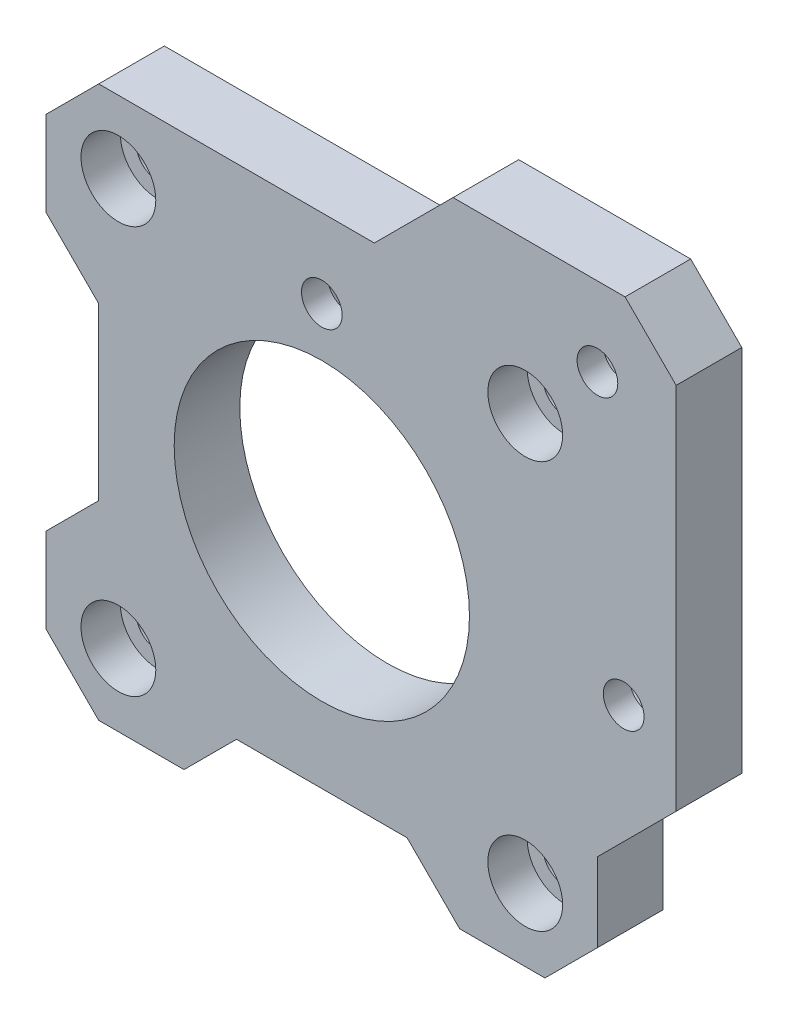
ISO-10303-21;
HEADER;
FILE_DESCRIPTION(('STEP AP214'),'2;1');
FILE_NAME('part.step','',(''),(''),'','','');
FILE_SCHEMA(('AUTOMOTIVE_DESIGN { 1 0 10303 214 1 1 1 1 }'));
ENDSEC;
DATA;
#1=APPLICATION_CONTEXT('core data for automotive mechanical design processes');
#2=APPLICATION_PROTOCOL_DEFINITION('international standard','automotive_design',2000,#1);
#3=PRODUCT_CONTEXT('',#1,'mechanical');
#4=PRODUCT('Part','Part','',(#3));
#5=PRODUCT_RELATED_PRODUCT_CATEGORY('part','',(#4));
#6=PRODUCT_DEFINITION_FORMATION('','',#4);
#7=PRODUCT_DEFINITION_CONTEXT('part definition',#1,'design');
#8=PRODUCT_DEFINITION('design','',#6,#7);
#9=PRODUCT_DEFINITION_SHAPE('','',#8);
#10=(LENGTH_UNIT() NAMED_UNIT(*) SI_UNIT(.MILLI.,.METRE.));
#11=(NAMED_UNIT(*) PLANE_ANGLE_UNIT() SI_UNIT($,.RADIAN.));
#12=(NAMED_UNIT(*) SI_UNIT($,.STERADIAN.) SOLID_ANGLE_UNIT());
#13=UNCERTAINTY_MEASURE_WITH_UNIT(LENGTH_MEASURE(1.E-05),#10,'distance_accuracy_value','');
#14=(GEOMETRIC_REPRESENTATION_CONTEXT(3) GLOBAL_UNCERTAINTY_ASSIGNED_CONTEXT((#13)) GLOBAL_UNIT_ASSIGNED_CONTEXT((#10,
#11,#12)) REPRESENTATION_CONTEXT('',''));
#15=CARTESIAN_POINT('',(0.,0.,0.));
#16=DIRECTION('',(0.,0.,1.));
#17=DIRECTION('',(1.,0.,0.));
#18=AXIS2_PLACEMENT_3D('',#15,#16,#17);
#19=CARTESIAN_POINT('',(0.,15.,0.));
#20=DIRECTION('',(0.,0.,1.));
#21=DIRECTION('',(1.,0.,0.));
#22=AXIS2_PLACEMENT_3D('',#19,#20,#21);
#23=CYLINDRICAL_SURFACE('',#22,1.55);
#24=CARTESIAN_POINT('',(0.,15.,5.));
#25=DIRECTION('',(0.,0.,1.));
#26=DIRECTION('',(1.,0.,0.));
#27=AXIS2_PLACEMENT_3D('',#24,#25,#26);
#28=CIRCLE('',#27,1.55);
#29=CARTESIAN_POINT('',(1.55,15.,5.));
#30=VERTEX_POINT('',#29);
#31=EDGE_CURVE('E517',#30,#30,#28,.T.);
#32=ORIENTED_EDGE('',*,*,#31,.T.);
#33=EDGE_LOOP('',(#32));
#34=FACE_BOUND('',#33,.T.);
#35=CARTESIAN_POINT('',(0.,15.,3.));
#36=DIRECTION('',(0.,0.,-1.));
#37=DIRECTION('',(-1.,0.,0.));
#38=AXIS2_PLACEMENT_3D('',#35,#36,#37);
#39=CIRCLE('',#38,1.55);
#40=CARTESIAN_POINT('',(-1.55,15.,3.));
#41=VERTEX_POINT('',#40);
#42=EDGE_CURVE('E38',#41,#41,#39,.F.);
#43=ORIENTED_EDGE('',*,*,#42,.F.);
#44=EDGE_LOOP('',(#43));
#45=FACE_BOUND('',#44,.T.);
#46=ADVANCED_FACE('F34',(#34,#45),#23,.F.);
#47=CARTESIAN_POINT('',(23.,0.,0.));
#48=DIRECTION('',(0.,0.,1.));
#49=DIRECTION('',(1.,0.,0.));
#50=AXIS2_PLACEMENT_3D('',#47,#48,#49);
#51=CYLINDRICAL_SURFACE('',#50,1.55);
#52=CARTESIAN_POINT('',(23.,0.,5.));
#53=DIRECTION('',(0.,0.,1.));
#54=DIRECTION('',(1.,0.,0.));
#55=AXIS2_PLACEMENT_3D('',#52,#53,#54);
#56=CIRCLE('',#55,1.55);
#57=CARTESIAN_POINT('',(24.55,0.,5.));
#58=VERTEX_POINT('',#57);
#59=EDGE_CURVE('E511',#58,#58,#56,.T.);
#60=ORIENTED_EDGE('',*,*,#59,.T.);
#61=EDGE_LOOP('',(#60));
#62=FACE_BOUND('',#61,.T.);
#63=CARTESIAN_POINT('',(23.,0.,3.));
#64=DIRECTION('',(0.,0.,-1.));
#65=DIRECTION('',(-1.,0.,0.));
#66=AXIS2_PLACEMENT_3D('',#63,#64,#65);
#67=CIRCLE('',#66,1.55);
#68=CARTESIAN_POINT('',(21.45,0.,3.));
#69=VERTEX_POINT('',#68);
#70=EDGE_CURVE('E372',#69,#69,#67,.F.);
#71=ORIENTED_EDGE('',*,*,#70,.F.);
#72=EDGE_LOOP('',(#71));
#73=FACE_BOUND('',#72,.T.);
#74=ADVANCED_FACE('F644',(#62,#73),#51,.F.);
#75=CARTESIAN_POINT('',(21.,21.,0.));
#76=DIRECTION('',(0.,0.,1.));
#77=DIRECTION('',(1.,0.,0.));
#78=AXIS2_PLACEMENT_3D('',#75,#76,#77);
#79=CYLINDRICAL_SURFACE('',#78,1.55);
#80=CARTESIAN_POINT('',(21.,21.,5.));
#81=DIRECTION('',(0.,0.,1.));
#82=DIRECTION('',(1.,0.,0.));
#83=AXIS2_PLACEMENT_3D('',#80,#81,#82);
#84=CIRCLE('',#83,1.55);
#85=CARTESIAN_POINT('',(22.55,21.,5.));
#86=VERTEX_POINT('',#85);
#87=EDGE_CURVE('E514',#86,#86,#84,.T.);
#88=ORIENTED_EDGE('',*,*,#87,.T.);
#89=EDGE_LOOP('',(#88));
#90=FACE_BOUND('',#89,.T.);
#91=CARTESIAN_POINT('',(21.,21.,3.));
#92=DIRECTION('',(0.,0.,-1.));
#93=DIRECTION('',(-1.,0.,0.));
#94=AXIS2_PLACEMENT_3D('',#91,#92,#93);
#95=CIRCLE('',#94,1.55);
#96=CARTESIAN_POINT('',(19.45,21.,3.));
#97=VERTEX_POINT('',#96);
#98=EDGE_CURVE('E420',#97,#97,#95,.F.);
#99=ORIENTED_EDGE('',*,*,#98,.F.);
#100=EDGE_LOOP('',(#99));
#101=FACE_BOUND('',#100,.T.);
#102=ADVANCED_FACE('F646',(#90,#101),#79,.F.);
#103=CARTESIAN_POINT('',(-21.,-21.,5.));
#104=DIRECTION('',(1.,0.,0.));
#105=DIRECTION('',(0.,0.,-1.));
#106=AXIS2_PLACEMENT_3D('',#103,#104,#105);
#107=PLANE('',#106);
#108=DIRECTION('',(0.,-1.,0.));
#109=VECTOR('',#108,1.);
#110=CARTESIAN_POINT('',(-21.,-21.,0.));
#111=LINE('',#110,#109);
#112=CARTESIAN_POINT('',(-21.,17.,0.));
#113=VERTEX_POINT('',#112);
#114=CARTESIAN_POINT('',(-21.,10.5,0.));
#115=VERTEX_POINT('',#114);
#116=EDGE_CURVE('E563',#113,#115,#111,.T.);
#117=ORIENTED_EDGE('',*,*,#116,.T.);
#118=DIRECTION('',(0.,0.,1.));
#119=VECTOR('',#118,1.);
#120=CARTESIAN_POINT('',(-21.,10.5,0.));
#121=LINE('',#120,#119);
#122=CARTESIAN_POINT('',(-21.,10.5,5.));
#123=VERTEX_POINT('',#122);
#124=EDGE_CURVE('E449',#115,#123,#121,.T.);
#125=ORIENTED_EDGE('',*,*,#124,.T.);
#126=DIRECTION('',(0.,-1.,0.));
#127=VECTOR('',#126,1.);
#128=CARTESIAN_POINT('',(-21.,-21.,5.));
#129=LINE('',#128,#127);
#130=CARTESIAN_POINT('',(-21.,17.,5.));
#131=VERTEX_POINT('',#130);
#132=EDGE_CURVE('E539',#131,#123,#129,.T.);
#133=ORIENTED_EDGE('',*,*,#132,.F.);
#134=DIRECTION('',(0.,0.,-1.));
#135=VECTOR('',#134,1.);
#136=CARTESIAN_POINT('',(-21.,17.,5.));
#137=LINE('',#136,#135);
#138=EDGE_CURVE('E616',#131,#113,#137,.T.);
#139=ORIENTED_EDGE('',*,*,#138,.T.);
#140=EDGE_LOOP('',(#117,#125,#133,#139));
#141=FACE_BOUND('',#140,.T.);
#142=ADVANCED_FACE('F653',(#141),#107,.F.);
#143=CARTESIAN_POINT('',(-21.,-21.,5.));
#144=DIRECTION('',(0.,1.,0.));
#145=DIRECTION('',(0.,0.,1.));
#146=AXIS2_PLACEMENT_3D('',#143,#144,#145);
#147=PLANE('',#146);
#148=DIRECTION('',(1.,0.,0.));
#149=VECTOR('',#148,1.);
#150=CARTESIAN_POINT('',(-21.,-21.,0.));
#151=LINE('',#150,#149);
#152=CARTESIAN_POINT('',(-17.,-21.,0.));
#153=VERTEX_POINT('',#152);
#154=CARTESIAN_POINT('',(-10.5,-21.,0.));
#155=VERTEX_POINT('',#154);
#156=EDGE_CURVE('E567',#153,#155,#151,.T.);
#157=ORIENTED_EDGE('',*,*,#156,.T.);
#158=DIRECTION('',(0.,0.,1.));
#159=VECTOR('',#158,1.);
#160=CARTESIAN_POINT('',(-10.5,-21.,0.));
#161=LINE('',#160,#159);
#162=CARTESIAN_POINT('',(-10.5,-21.,5.));
#163=VERTEX_POINT('',#162);
#164=EDGE_CURVE('E475',#155,#163,#161,.T.);
#165=ORIENTED_EDGE('',*,*,#164,.T.);
#166=DIRECTION('',(1.,0.,0.));
#167=VECTOR('',#166,1.);
#168=CARTESIAN_POINT('',(-21.,-21.,5.));
#169=LINE('',#168,#167);
#170=CARTESIAN_POINT('',(-17.,-21.,5.));
#171=VERTEX_POINT('',#170);
#172=EDGE_CURVE('E544',#171,#163,#169,.T.);
#173=ORIENTED_EDGE('',*,*,#172,.F.);
#174=DIRECTION('',(0.,0.,-1.));
#175=VECTOR('',#174,1.);
#176=CARTESIAN_POINT('',(-17.,-21.,5.));
#177=LINE('',#176,#175);
#178=EDGE_CURVE('E605',#171,#153,#177,.T.);
#179=ORIENTED_EDGE('',*,*,#178,.T.);
#180=EDGE_LOOP('',(#157,#165,#173,#179));
#181=FACE_BOUND('',#180,.T.);
#182=ADVANCED_FACE('F675',(#181),#147,.F.);
#183=CARTESIAN_POINT('',(15.5,15.5,0.));
#184=DIRECTION('',(0.,0.,1.));
#185=DIRECTION('',(1.,0.,0.));
#186=AXIS2_PLACEMENT_3D('',#183,#184,#185);
#187=CYLINDRICAL_SURFACE('',#186,1.65);
#188=CARTESIAN_POINT('',(15.5,15.5,0.));
#189=DIRECTION('',(0.,0.,1.));
#190=DIRECTION('',(1.,0.,0.));
#191=AXIS2_PLACEMENT_3D('',#188,#189,#190);
#192=CIRCLE('',#191,1.65);
#193=CARTESIAN_POINT('',(17.15,15.5,0.));
#194=VERTEX_POINT('',#193);
#195=EDGE_CURVE('E526',#194,#194,#192,.T.);
#196=ORIENTED_EDGE('',*,*,#195,.F.);
#197=EDGE_LOOP('',(#196));
#198=FACE_BOUND('',#197,.T.);
#199=CARTESIAN_POINT('',(15.5,15.5,2.));
#200=DIRECTION('',(0.,0.,1.));
#201=DIRECTION('',(1.,0.,0.));
#202=AXIS2_PLACEMENT_3D('',#199,#200,#201);
#203=CIRCLE('',#202,1.65);
#204=CARTESIAN_POINT('',(17.15,15.5,2.));
#205=VERTEX_POINT('',#204);
#206=EDGE_CURVE('E487',#205,#205,#203,.F.);
#207=ORIENTED_EDGE('',*,*,#206,.F.);
#208=EDGE_LOOP('',(#207));
#209=FACE_BOUND('',#208,.T.);
#210=ADVANCED_FACE('F672',(#198,#209),#187,.F.);
#211=CARTESIAN_POINT('',(-15.5,15.5,0.));
#212=DIRECTION('',(0.,0.,1.));
#213=DIRECTION('',(1.,0.,0.));
#214=AXIS2_PLACEMENT_3D('',#211,#212,#213);
#215=CYLINDRICAL_SURFACE('',#214,1.65);
#216=CARTESIAN_POINT('',(-15.5,15.5,0.));
#217=DIRECTION('',(0.,0.,1.));
#218=DIRECTION('',(1.,0.,0.));
#219=AXIS2_PLACEMENT_3D('',#216,#217,#218);
#220=CIRCLE('',#219,1.65);
#221=CARTESIAN_POINT('',(-13.85,15.5,0.));
#222=VERTEX_POINT('',#221);
#223=EDGE_CURVE('E529',#222,#222,#220,.T.);
#224=ORIENTED_EDGE('',*,*,#223,.F.);
#225=EDGE_LOOP('',(#224));
#226=FACE_BOUND('',#225,.T.);
#227=CARTESIAN_POINT('',(-15.5,15.5,2.));
#228=DIRECTION('',(0.,0.,1.));
#229=DIRECTION('',(1.,0.,0.));
#230=AXIS2_PLACEMENT_3D('',#227,#228,#229);
#231=CIRCLE('',#230,1.65);
#232=CARTESIAN_POINT('',(-13.85,15.5,2.));
#233=VERTEX_POINT('',#232);
#234=EDGE_CURVE('E493',#233,#233,#231,.F.);
#235=ORIENTED_EDGE('',*,*,#234,.F.);
#236=EDGE_LOOP('',(#235));
#237=FACE_BOUND('',#236,.T.);
#238=ADVANCED_FACE('F666',(#226,#237),#215,.F.);
#239=CARTESIAN_POINT('',(15.5,-15.5,0.));
#240=DIRECTION('',(0.,0.,1.));
#241=DIRECTION('',(1.,0.,0.));
#242=AXIS2_PLACEMENT_3D('',#239,#240,#241);
#243=CYLINDRICAL_SURFACE('',#242,1.65);
#244=CARTESIAN_POINT('',(15.5,-15.5,0.));
#245=DIRECTION('',(0.,0.,1.));
#246=DIRECTION('',(1.,0.,0.));
#247=AXIS2_PLACEMENT_3D('',#244,#245,#246);
#248=CIRCLE('',#247,1.65);
#249=CARTESIAN_POINT('',(17.15,-15.5,0.));
#250=VERTEX_POINT('',#249);
#251=EDGE_CURVE('E520',#250,#250,#248,.T.);
#252=ORIENTED_EDGE('',*,*,#251,.F.);
#253=EDGE_LOOP('',(#252));
#254=FACE_BOUND('',#253,.T.);
#255=CARTESIAN_POINT('',(15.5,-15.5,2.));
#256=DIRECTION('',(0.,0.,1.));
#257=DIRECTION('',(1.,0.,0.));
#258=AXIS2_PLACEMENT_3D('',#255,#256,#257);
#259=CIRCLE('',#258,1.65);
#260=CARTESIAN_POINT('',(17.15,-15.5,2.));
#261=VERTEX_POINT('',#260);
#262=EDGE_CURVE('E500',#261,#261,#259,.F.);
#263=ORIENTED_EDGE('',*,*,#262,.F.);
#264=EDGE_LOOP('',(#263));
#265=FACE_BOUND('',#264,.T.);
#266=ADVANCED_FACE('F662',(#254,#265),#243,.F.);
#267=CARTESIAN_POINT('',(-15.5,-15.5,0.));
#268=DIRECTION('',(0.,0.,1.));
#269=DIRECTION('',(1.,0.,0.));
#270=AXIS2_PLACEMENT_3D('',#267,#268,#269);
#271=CYLINDRICAL_SURFACE('',#270,1.65);
#272=CARTESIAN_POINT('',(-15.5,-15.5,0.));
#273=DIRECTION('',(0.,0.,1.));
#274=DIRECTION('',(1.,0.,0.));
#275=AXIS2_PLACEMENT_3D('',#272,#273,#274);
#276=CIRCLE('',#275,1.65);
#277=CARTESIAN_POINT('',(-13.85,-15.5,0.));
#278=VERTEX_POINT('',#277);
#279=EDGE_CURVE('E523',#278,#278,#276,.T.);
#280=ORIENTED_EDGE('',*,*,#279,.F.);
#281=EDGE_LOOP('',(#280));
#282=FACE_BOUND('',#281,.T.);
#283=CARTESIAN_POINT('',(-15.5,-15.5,2.));
#284=DIRECTION('',(0.,0.,1.));
#285=DIRECTION('',(1.,0.,0.));
#286=AXIS2_PLACEMENT_3D('',#283,#284,#285);
#287=CIRCLE('',#286,1.65);
#288=CARTESIAN_POINT('',(-13.85,-15.5,2.));
#289=VERTEX_POINT('',#288);
#290=EDGE_CURVE('E507',#289,#289,#287,.F.);
#291=ORIENTED_EDGE('',*,*,#290,.F.);
#292=EDGE_LOOP('',(#291));
#293=FACE_BOUND('',#292,.T.);
#294=ADVANCED_FACE('F665',(#282,#293),#271,.F.);
#295=CARTESIAN_POINT('',(-21.,-10.5,5.));
#296=VERTEX_POINT('',#295);
#297=CARTESIAN_POINT('',(-21.,-17.,5.));
#298=VERTEX_POINT('',#297);
#299=EDGE_CURVE('E543',#296,#298,#129,.T.);
#300=ORIENTED_EDGE('',*,*,#299,.F.);
#301=DIRECTION('',(0.,0.,1.));
#302=VECTOR('',#301,1.);
#303=CARTESIAN_POINT('',(-21.,-10.5,0.));
#304=LINE('',#303,#302);
#305=CARTESIAN_POINT('',(-21.,-10.5,0.));
#306=VERTEX_POINT('',#305);
#307=EDGE_CURVE('E441',#306,#296,#304,.T.);
#308=ORIENTED_EDGE('',*,*,#307,.F.);
#309=CARTESIAN_POINT('',(-21.,-17.,0.));
#310=VERTEX_POINT('',#309);
#311=EDGE_CURVE('E536',#306,#310,#111,.T.);
#312=ORIENTED_EDGE('',*,*,#311,.T.);
#313=DIRECTION('',(0.,0.,1.));
#314=VECTOR('',#313,1.);
#315=CARTESIAN_POINT('',(-21.,-17.,5.));
#316=LINE('',#315,#314);
#317=EDGE_CURVE('E619',#310,#298,#316,.T.);
#318=ORIENTED_EDGE('',*,*,#317,.T.);
#319=EDGE_LOOP('',(#300,#308,#312,#318));
#320=FACE_BOUND('',#319,.T.);
#321=ADVANCED_FACE('F670',(#320),#107,.F.);
#322=CARTESIAN_POINT('',(10.5,-21.,5.));
#323=VERTEX_POINT('',#322);
#324=CARTESIAN_POINT('',(17.,-21.,5.));
#325=VERTEX_POINT('',#324);
#326=EDGE_CURVE('E542',#323,#325,#169,.T.);
#327=ORIENTED_EDGE('',*,*,#326,.F.);
#328=DIRECTION('',(0.,0.,1.));
#329=VECTOR('',#328,1.);
#330=CARTESIAN_POINT('',(10.5,-21.,0.));
#331=LINE('',#330,#329);
#332=CARTESIAN_POINT('',(10.5,-21.,0.));
#333=VERTEX_POINT('',#332);
#334=EDGE_CURVE('E468',#333,#323,#331,.T.);
#335=ORIENTED_EDGE('',*,*,#334,.F.);
#336=CARTESIAN_POINT('',(17.,-21.,0.));
#337=VERTEX_POINT('',#336);
#338=EDGE_CURVE('E566',#333,#337,#151,.T.);
#339=ORIENTED_EDGE('',*,*,#338,.T.);
#340=DIRECTION('',(0.,0.,1.));
#341=VECTOR('',#340,1.);
#342=CARTESIAN_POINT('',(17.,-21.,5.));
#343=LINE('',#342,#341);
#344=EDGE_CURVE('E602',#337,#325,#343,.T.);
#345=ORIENTED_EDGE('',*,*,#344,.T.);
#346=EDGE_LOOP('',(#327,#335,#339,#345));
#347=FACE_BOUND('',#346,.T.);
#348=ADVANCED_FACE('F721',(#347),#147,.F.);
#349=CARTESIAN_POINT('',(21.,-21.,5.));
#350=DIRECTION('',(-1.,0.,0.));
#351=DIRECTION('',(0.,-1.,0.));
#352=AXIS2_PLACEMENT_3D('',#349,#350,#351);
#353=PLANE('',#352);
#354=DIRECTION('',(0.,1.,0.));
#355=VECTOR('',#354,1.);
#356=CARTESIAN_POINT('',(21.,-21.,5.));
#357=LINE('',#356,#355);
#358=CARTESIAN_POINT('',(21.,-17.,5.));
#359=VERTEX_POINT('',#358);
#360=CARTESIAN_POINT('',(21.,-11.,5.));
#361=VERTEX_POINT('',#360);
#362=EDGE_CURVE('E547',#359,#361,#357,.T.);
#363=ORIENTED_EDGE('',*,*,#362,.F.);
#364=DIRECTION('',(0.,0.,-1.));
#365=VECTOR('',#364,1.);
#366=CARTESIAN_POINT('',(21.,-17.,5.));
#367=LINE('',#366,#365);
#368=CARTESIAN_POINT('',(21.,-17.,0.));
#369=VERTEX_POINT('',#368);
#370=EDGE_CURVE('E43',#359,#369,#367,.T.);
#371=ORIENTED_EDGE('',*,*,#370,.T.);
#372=DIRECTION('',(0.,1.,0.));
#373=VECTOR('',#372,1.);
#374=CARTESIAN_POINT('',(21.,-21.,0.));
#375=LINE('',#374,#373);
#376=CARTESIAN_POINT('',(21.,-11.,0.));
#377=VERTEX_POINT('',#376);
#378=EDGE_CURVE('E570',#369,#377,#375,.T.);
#379=ORIENTED_EDGE('',*,*,#378,.T.);
#380=DIRECTION('',(0.,0.,-1.));
#381=VECTOR('',#380,1.);
#382=CARTESIAN_POINT('',(21.,-11.,5.));
#383=LINE('',#382,#381);
#384=EDGE_CURVE('E599',#361,#377,#383,.T.);
#385=ORIENTED_EDGE('',*,*,#384,.F.);
#386=EDGE_LOOP('',(#363,#371,#379,#385));
#387=FACE_BOUND('',#386,.T.);
#388=ADVANCED_FACE('F717',(#387),#353,.F.);
#389=CARTESIAN_POINT('',(21.,-11.,5.));
#390=DIRECTION('',(-0.707106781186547,0.707106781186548,0.));
#391=DIRECTION('',(-0.707106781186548,-0.707106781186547,0.));
#392=AXIS2_PLACEMENT_3D('',#389,#390,#391);
#393=PLANE('',#392);
#394=DIRECTION('',(0.707106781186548,0.707106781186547,0.));
#395=VECTOR('',#394,1.);
#396=CARTESIAN_POINT('',(21.,-11.,0.));
#397=LINE('',#396,#395);
#398=CARTESIAN_POINT('',(27.,-4.99999999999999,0.));
#399=VERTEX_POINT('',#398);
#400=EDGE_CURVE('E572',#377,#399,#397,.T.);
#401=ORIENTED_EDGE('',*,*,#400,.T.);
#402=DIRECTION('',(0.,0.,-1.));
#403=VECTOR('',#402,1.);
#404=CARTESIAN_POINT('',(27.,-4.99999999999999,5.));
#405=LINE('',#404,#403);
#406=CARTESIAN_POINT('',(27.,-4.99999999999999,5.));
#407=VERTEX_POINT('',#406);
#408=EDGE_CURVE('E596',#407,#399,#405,.T.);
#409=ORIENTED_EDGE('',*,*,#408,.F.);
#410=DIRECTION('',(0.707106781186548,0.707106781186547,0.));
#411=VECTOR('',#410,1.);
#412=CARTESIAN_POINT('',(21.,-11.,5.));
#413=LINE('',#412,#411);
#414=EDGE_CURVE('E549',#361,#407,#413,.T.);
#415=ORIENTED_EDGE('',*,*,#414,.F.);
#416=ORIENTED_EDGE('',*,*,#384,.T.);
#417=EDGE_LOOP('',(#401,#409,#415,#416));
#418=FACE_BOUND('',#417,.T.);
#419=ADVANCED_FACE('F713',(#418),#393,.F.);
#420=CARTESIAN_POINT('',(27.,-4.99999999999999,5.));
#421=DIRECTION('',(-1.,0.,0.));
#422=DIRECTION('',(0.,0.,1.));
#423=AXIS2_PLACEMENT_3D('',#420,#421,#422);
#424=PLANE('',#423);
#425=DIRECTION('',(0.,1.,0.));
#426=VECTOR('',#425,1.);
#427=CARTESIAN_POINT('',(27.,-4.99999999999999,0.));
#428=LINE('',#427,#426);
#429=CARTESIAN_POINT('',(27.,23.1066453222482,0.));
#430=VERTEX_POINT('',#429);
#431=EDGE_CURVE('E574',#399,#430,#428,.T.);
#432=ORIENTED_EDGE('',*,*,#431,.T.);
#433=DIRECTION('',(0.,0.,-1.));
#434=VECTOR('',#433,1.);
#435=CARTESIAN_POINT('',(27.,23.1066453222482,5.));
#436=LINE('',#435,#434);
#437=CARTESIAN_POINT('',(27.,23.1066453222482,5.));
#438=VERTEX_POINT('',#437);
#439=EDGE_CURVE('E593',#438,#430,#436,.T.);
#440=ORIENTED_EDGE('',*,*,#439,.F.);
#441=DIRECTION('',(0.,1.,0.));
#442=VECTOR('',#441,1.);
#443=CARTESIAN_POINT('',(27.,-4.99999999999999,5.));
#444=LINE('',#443,#442);
#445=EDGE_CURVE('E551',#407,#438,#444,.T.);
#446=ORIENTED_EDGE('',*,*,#445,.F.);
#447=ORIENTED_EDGE('',*,*,#408,.T.);
#448=EDGE_LOOP('',(#432,#440,#446,#447));
#449=FACE_BOUND('',#448,.T.);
#450=ADVANCED_FACE('F709',(#449),#424,.F.);
#451=CARTESIAN_POINT('',(27.,23.1066453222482,5.));
#452=DIRECTION('',(-0.707106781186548,-0.707106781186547,0.));
#453=DIRECTION('',(0.707106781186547,-0.707106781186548,0.));
#454=AXIS2_PLACEMENT_3D('',#451,#452,#453);
#455=PLANE('',#454);
#456=DIRECTION('',(-0.707106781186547,0.707106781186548,0.));
#457=VECTOR('',#456,1.);
#458=CARTESIAN_POINT('',(27.,23.1066453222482,0.));
#459=LINE('',#458,#457);
#460=CARTESIAN_POINT('',(23.1066453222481,27.,0.));
#461=VERTEX_POINT('',#460);
#462=EDGE_CURVE('E576',#430,#461,#459,.T.);
#463=ORIENTED_EDGE('',*,*,#462,.T.);
#464=DIRECTION('',(0.,0.,-1.));
#465=VECTOR('',#464,1.);
#466=CARTESIAN_POINT('',(23.1066453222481,27.,5.));
#467=LINE('',#466,#465);
#468=CARTESIAN_POINT('',(23.1066453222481,27.,5.));
#469=VERTEX_POINT('',#468);
#470=EDGE_CURVE('E590',#469,#461,#467,.T.);
#471=ORIENTED_EDGE('',*,*,#470,.F.);
#472=DIRECTION('',(-0.707106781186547,0.707106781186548,0.));
#473=VECTOR('',#472,1.);
#474=CARTESIAN_POINT('',(27.,23.1066453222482,5.));
#475=LINE('',#474,#473);
#476=EDGE_CURVE('E553',#438,#469,#475,.T.);
#477=ORIENTED_EDGE('',*,*,#476,.F.);
#478=ORIENTED_EDGE('',*,*,#439,.T.);
#479=EDGE_LOOP('',(#463,#471,#477,#478));
#480=FACE_BOUND('',#479,.T.);
#481=ADVANCED_FACE('F705',(#480),#455,.F.);
#482=CARTESIAN_POINT('',(23.1066453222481,27.,5.));
#483=DIRECTION('',(0.,-1.,0.));
#484=DIRECTION('',(0.,0.,-1.));
#485=AXIS2_PLACEMENT_3D('',#482,#483,#484);
#486=PLANE('',#485);
#487=DIRECTION('',(-1.,0.,0.));
#488=VECTOR('',#487,1.);
#489=CARTESIAN_POINT('',(23.1066453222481,27.,0.));
#490=LINE('',#489,#488);
#491=CARTESIAN_POINT('',(9.99999999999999,27.,0.));
#492=VERTEX_POINT('',#491);
#493=EDGE_CURVE('E578',#461,#492,#490,.T.);
#494=ORIENTED_EDGE('',*,*,#493,.T.);
#495=DIRECTION('',(0.,0.,-1.));
#496=VECTOR('',#495,1.);
#497=CARTESIAN_POINT('',(9.99999999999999,27.,5.));
#498=LINE('',#497,#496);
#499=CARTESIAN_POINT('',(9.99999999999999,27.,5.));
#500=VERTEX_POINT('',#499);
#501=EDGE_CURVE('E587',#500,#492,#498,.T.);
#502=ORIENTED_EDGE('',*,*,#501,.F.);
#503=DIRECTION('',(-1.,0.,0.));
#504=VECTOR('',#503,1.);
#505=CARTESIAN_POINT('',(23.1066453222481,27.,5.));
#506=LINE('',#505,#504);
#507=EDGE_CURVE('E555',#469,#500,#506,.T.);
#508=ORIENTED_EDGE('',*,*,#507,.F.);
#509=ORIENTED_EDGE('',*,*,#470,.T.);
#510=EDGE_LOOP('',(#494,#502,#508,#509));
#511=FACE_BOUND('',#510,.T.);
#512=ADVANCED_FACE('F701',(#511),#486,.F.);
#513=CARTESIAN_POINT('',(9.99999999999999,27.,5.));
#514=DIRECTION('',(0.707106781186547,-0.707106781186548,0.));
#515=DIRECTION('',(0.707106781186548,0.707106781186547,0.));
#516=AXIS2_PLACEMENT_3D('',#513,#514,#515);
#517=PLANE('',#516);
#518=DIRECTION('',(-0.707106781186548,-0.707106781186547,0.));
#519=VECTOR('',#518,1.);
#520=CARTESIAN_POINT('',(9.99999999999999,27.,0.));
#521=LINE('',#520,#519);
#522=CARTESIAN_POINT('',(3.99999999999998,21.,0.));
#523=VERTEX_POINT('',#522);
#524=EDGE_CURVE('E580',#492,#523,#521,.T.);
#525=ORIENTED_EDGE('',*,*,#524,.T.);
#526=DIRECTION('',(0.,0.,-1.));
#527=VECTOR('',#526,1.);
#528=CARTESIAN_POINT('',(3.99999999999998,21.,5.));
#529=LINE('',#528,#527);
#530=CARTESIAN_POINT('',(3.99999999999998,21.,5.));
#531=VERTEX_POINT('',#530);
#532=EDGE_CURVE('E562',#531,#523,#529,.T.);
#533=ORIENTED_EDGE('',*,*,#532,.F.);
#534=DIRECTION('',(-0.707106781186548,-0.707106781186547,0.));
#535=VECTOR('',#534,1.);
#536=CARTESIAN_POINT('',(9.99999999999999,27.,5.));
#537=LINE('',#536,#535);
#538=EDGE_CURVE('E557',#500,#531,#537,.T.);
#539=ORIENTED_EDGE('',*,*,#538,.F.);
#540=ORIENTED_EDGE('',*,*,#501,.T.);
#541=EDGE_LOOP('',(#525,#533,#539,#540));
#542=FACE_BOUND('',#541,.T.);
#543=ADVANCED_FACE('F697',(#542),#517,.F.);
#544=CARTESIAN_POINT('',(-21.,21.,5.));
#545=DIRECTION('',(0.,-1.,0.));
#546=DIRECTION('',(0.,0.,-1.));
#547=AXIS2_PLACEMENT_3D('',#544,#545,#546);
#548=PLANE('',#547);
#549=DIRECTION('',(-1.,0.,0.));
#550=VECTOR('',#549,1.);
#551=CARTESIAN_POINT('',(-21.,21.,0.));
#552=LINE('',#551,#550);
#553=CARTESIAN_POINT('',(-17.,21.,0.));
#554=VERTEX_POINT('',#553);
#555=EDGE_CURVE('E582',#523,#554,#552,.T.);
#556=ORIENTED_EDGE('',*,*,#555,.T.);
#557=DIRECTION('',(0.,0.,1.));
#558=VECTOR('',#557,1.);
#559=CARTESIAN_POINT('',(-17.,21.,5.));
#560=LINE('',#559,#558);
#561=CARTESIAN_POINT('',(-17.,21.,5.));
#562=VERTEX_POINT('',#561);
#563=EDGE_CURVE('E11',#554,#562,#560,.T.);
#564=ORIENTED_EDGE('',*,*,#563,.T.);
#565=DIRECTION('',(-1.,0.,0.));
#566=VECTOR('',#565,1.);
#567=CARTESIAN_POINT('',(-21.,21.,5.));
#568=LINE('',#567,#566);
#569=EDGE_CURVE('E559',#531,#562,#568,.T.);
#570=ORIENTED_EDGE('',*,*,#569,.F.);
#571=ORIENTED_EDGE('',*,*,#532,.T.);
#572=EDGE_LOOP('',(#556,#564,#570,#571));
#573=FACE_BOUND('',#572,.T.);
#574=ADVANCED_FACE('F689',(#573),#548,.F.);
#575=CARTESIAN_POINT('',(0.,0.,5.));
#576=DIRECTION('',(0.,0.,-1.));
#577=DIRECTION('',(-1.,0.,0.));
#578=AXIS2_PLACEMENT_3D('',#575,#576,#577);
#579=PLANE('',#578);
#580=CARTESIAN_POINT('',(15.5,15.5,5.));
#581=DIRECTION('',(0.,0.,1.));
#582=DIRECTION('',(1.,0.,0.));
#583=AXIS2_PLACEMENT_3D('',#580,#581,#582);
#584=CIRCLE('',#583,2.85);
#585=CARTESIAN_POINT('',(18.35,15.5,5.));
#586=VERTEX_POINT('',#585);
#587=EDGE_CURVE('E478',#586,#586,#584,.T.);
#588=ORIENTED_EDGE('',*,*,#587,.F.);
#589=EDGE_LOOP('',(#588));
#590=FACE_BOUND('',#589,.T.);
#591=CARTESIAN_POINT('',(-15.5,15.5,5.));
#592=DIRECTION('',(0.,0.,1.));
#593=DIRECTION('',(1.,0.,0.));
#594=AXIS2_PLACEMENT_3D('',#591,#592,#593);
#595=CIRCLE('',#594,2.85);
#596=CARTESIAN_POINT('',(-12.65,15.5,5.));
#597=VERTEX_POINT('',#596);
#598=EDGE_CURVE('E494',#597,#597,#595,.T.);
#599=ORIENTED_EDGE('',*,*,#598,.F.);
#600=EDGE_LOOP('',(#599));
#601=FACE_BOUND('',#600,.T.);
#602=CARTESIAN_POINT('',(15.5,-15.5,5.));
#603=DIRECTION('',(0.,0.,1.));
#604=DIRECTION('',(1.,0.,0.));
#605=AXIS2_PLACEMENT_3D('',#602,#603,#604);
#606=CIRCLE('',#605,2.85);
#607=CARTESIAN_POINT('',(18.35,-15.5,5.));
#608=VERTEX_POINT('',#607);
#609=EDGE_CURVE('E501',#608,#608,#606,.T.);
#610=ORIENTED_EDGE('',*,*,#609,.F.);
#611=EDGE_LOOP('',(#610));
#612=FACE_BOUND('',#611,.T.);
#613=CARTESIAN_POINT('',(-15.5,-15.5,5.));
#614=DIRECTION('',(0.,0.,1.));
#615=DIRECTION('',(1.,0.,0.));
#616=AXIS2_PLACEMENT_3D('',#613,#614,#615);
#617=CIRCLE('',#616,2.85);
#618=CARTESIAN_POINT('',(-12.65,-15.5,5.));
#619=VERTEX_POINT('',#618);
#620=EDGE_CURVE('E508',#619,#619,#617,.T.);
#621=ORIENTED_EDGE('',*,*,#620,.F.);
#622=EDGE_LOOP('',(#621));
#623=FACE_BOUND('',#622,.T.);
#624=ORIENTED_EDGE('',*,*,#59,.F.);
#625=EDGE_LOOP('',(#624));
#626=FACE_BOUND('',#625,.T.);
#627=ORIENTED_EDGE('',*,*,#87,.F.);
#628=EDGE_LOOP('',(#627));
#629=FACE_BOUND('',#628,.T.);
#630=ORIENTED_EDGE('',*,*,#31,.F.);
#631=EDGE_LOOP('',(#630));
#632=FACE_BOUND('',#631,.T.);
#633=CARTESIAN_POINT('',(0.,0.,5.));
#634=DIRECTION('',(0.,0.,1.));
#635=DIRECTION('',(1.,0.,0.));
#636=AXIS2_PLACEMENT_3D('',#633,#634,#635);
#637=CIRCLE('',#636,11.25);
#638=CARTESIAN_POINT('',(11.25,0.,5.));
#639=VERTEX_POINT('',#638);
#640=EDGE_CURVE('E532',#639,#639,#637,.T.);
#641=ORIENTED_EDGE('',*,*,#640,.F.);
#642=EDGE_LOOP('',(#641));
#643=FACE_BOUND('',#642,.T.);
#644=ORIENTED_EDGE('',*,*,#132,.T.);
#645=DIRECTION('',(-0.707106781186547,0.707106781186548,0.));
#646=VECTOR('',#645,1.);
#647=CARTESIAN_POINT('',(-21.,10.5,5.));
#648=LINE('',#647,#646);
#649=CARTESIAN_POINT('',(-17.,6.50000000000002,5.));
#650=VERTEX_POINT('',#649);
#651=EDGE_CURVE('E435',#650,#123,#648,.T.);
#652=ORIENTED_EDGE('',*,*,#651,.F.);
#653=DIRECTION('',(0.,1.,0.));
#654=VECTOR('',#653,1.);
#655=CARTESIAN_POINT('',(-17.,-6.49999999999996,5.));
#656=LINE('',#655,#654);
#657=CARTESIAN_POINT('',(-17.,-6.49999999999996,5.));
#658=VERTEX_POINT('',#657);
#659=EDGE_CURVE('E445',#658,#650,#656,.T.);
#660=ORIENTED_EDGE('',*,*,#659,.F.);
#661=DIRECTION('',(0.707106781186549,0.707106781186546,0.));
#662=VECTOR('',#661,1.);
#663=CARTESIAN_POINT('',(-21.,-10.5,5.));
#664=LINE('',#663,#662);
#665=EDGE_CURVE('E442',#296,#658,#664,.T.);
#666=ORIENTED_EDGE('',*,*,#665,.F.);
#667=ORIENTED_EDGE('',*,*,#299,.T.);
#668=DIRECTION('',(-0.707106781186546,0.707106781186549,0.));
#669=VECTOR('',#668,1.);
#670=CARTESIAN_POINT('',(-17.,-21.,5.));
#671=LINE('',#670,#669);
#672=EDGE_CURVE('E626',#298,#171,#671,.F.);
#673=ORIENTED_EDGE('',*,*,#672,.T.);
#674=ORIENTED_EDGE('',*,*,#172,.T.);
#675=DIRECTION('',(-0.707106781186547,-0.707106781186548,0.));
#676=VECTOR('',#675,1.);
#677=CARTESIAN_POINT('',(-10.5,-21.,5.));
#678=LINE('',#677,#676);
#679=CARTESIAN_POINT('',(-6.49999999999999,-17.,5.));
#680=VERTEX_POINT('',#679);
#681=EDGE_CURVE('E462',#680,#163,#678,.T.);
#682=ORIENTED_EDGE('',*,*,#681,.F.);
#683=DIRECTION('',(-1.,0.,0.));
#684=VECTOR('',#683,1.);
#685=CARTESIAN_POINT('',(-6.49999999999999,-17.,5.));
#686=LINE('',#685,#684);
#687=CARTESIAN_POINT('',(6.49999999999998,-17.,5.));
#688=VERTEX_POINT('',#687);
#689=EDGE_CURVE('E471',#688,#680,#686,.T.);
#690=ORIENTED_EDGE('',*,*,#689,.F.);
#691=DIRECTION('',(-0.707106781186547,0.707106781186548,0.));
#692=VECTOR('',#691,1.);
#693=CARTESIAN_POINT('',(10.5,-21.,5.));
#694=LINE('',#693,#692);
#695=EDGE_CURVE('E452',#323,#688,#694,.T.);
#696=ORIENTED_EDGE('',*,*,#695,.F.);
#697=ORIENTED_EDGE('',*,*,#326,.T.);
#698=DIRECTION('',(-0.707106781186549,-0.707106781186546,0.));
#699=VECTOR('',#698,1.);
#700=CARTESIAN_POINT('',(21.,-17.,5.));
#701=LINE('',#700,#699);
#702=EDGE_CURVE('E624',#325,#359,#701,.F.);
#703=ORIENTED_EDGE('',*,*,#702,.T.);
#704=ORIENTED_EDGE('',*,*,#362,.T.);
#705=ORIENTED_EDGE('',*,*,#414,.T.);
#706=ORIENTED_EDGE('',*,*,#445,.T.);
#707=ORIENTED_EDGE('',*,*,#476,.T.);
#708=ORIENTED_EDGE('',*,*,#507,.T.);
#709=ORIENTED_EDGE('',*,*,#538,.T.);
#710=ORIENTED_EDGE('',*,*,#569,.T.);
#711=DIRECTION('',(0.707106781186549,0.707106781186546,0.));
#712=VECTOR('',#711,1.);
#713=CARTESIAN_POINT('',(-21.,17.,5.));
#714=LINE('',#713,#712);
#715=EDGE_CURVE('E622',#562,#131,#714,.F.);
#716=ORIENTED_EDGE('',*,*,#715,.T.);
#717=EDGE_LOOP('',(#644,#652,#660,#666,#667,#673,#674,#682,#690,#696,#697,#703,#704,#705,#706,
#707,#708,#709,#710,#716));
#718=FACE_BOUND('',#717,.T.);
#719=ADVANCED_FACE('F685',(#590,#601,#612,#623,#626,#629,#632,#643,#718),#579,.F.);
#720=CARTESIAN_POINT('',(0.,0.,0.));
#721=DIRECTION('',(0.,0.,-1.));
#722=DIRECTION('',(-1.,0.,0.));
#723=AXIS2_PLACEMENT_3D('',#720,#721,#722);
#724=PLANE('',#723);
#725=DIRECTION('',(-0.5,-0.866025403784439,0.));
#726=VECTOR('',#725,1.);
#727=CARTESIAN_POINT('',(3.29089653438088,15.,0.));
#728=LINE('',#727,#726);
#729=CARTESIAN_POINT('',(3.29089653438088,15.,0.));
#730=VERTEX_POINT('',#729);
#731=CARTESIAN_POINT('',(1.64544826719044,12.15,0.));
#732=VERTEX_POINT('',#731);
#733=EDGE_CURVE('E51',#730,#732,#728,.T.);
#734=ORIENTED_EDGE('',*,*,#733,.F.);
#735=DIRECTION('',(0.5,-0.866025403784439,0.));
#736=VECTOR('',#735,1.);
#737=CARTESIAN_POINT('',(1.64544826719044,17.85,0.));
#738=LINE('',#737,#736);
#739=CARTESIAN_POINT('',(1.64544826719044,17.85,0.));
#740=VERTEX_POINT('',#739);
#741=EDGE_CURVE('E302',#740,#730,#738,.T.);
#742=ORIENTED_EDGE('',*,*,#741,.F.);
#743=DIRECTION('',(1.,0.,0.));
#744=VECTOR('',#743,1.);
#745=CARTESIAN_POINT('',(-1.64544826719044,17.85,0.));
#746=LINE('',#745,#744);
#747=CARTESIAN_POINT('',(-1.64544826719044,17.85,0.));
#748=VERTEX_POINT('',#747);
#749=EDGE_CURVE('E305',#748,#740,#746,.T.);
#750=ORIENTED_EDGE('',*,*,#749,.F.);
#751=DIRECTION('',(0.5,0.866025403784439,0.));
#752=VECTOR('',#751,1.);
#753=CARTESIAN_POINT('',(-3.29089653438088,15.,0.));
#754=LINE('',#753,#752);
#755=CARTESIAN_POINT('',(-3.29089653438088,15.,0.));
#756=VERTEX_POINT('',#755);
#757=EDGE_CURVE('E321',#756,#748,#754,.T.);
#758=ORIENTED_EDGE('',*,*,#757,.F.);
#759=DIRECTION('',(-0.5,0.866025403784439,0.));
#760=VECTOR('',#759,1.);
#761=CARTESIAN_POINT('',(-1.64544826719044,12.15,0.));
#762=LINE('',#761,#760);
#763=CARTESIAN_POINT('',(-1.64544826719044,12.15,0.));
#764=VERTEX_POINT('',#763);
#765=EDGE_CURVE('E318',#764,#756,#762,.T.);
#766=ORIENTED_EDGE('',*,*,#765,.F.);
#767=DIRECTION('',(-1.,0.,0.));
#768=VECTOR('',#767,1.);
#769=CARTESIAN_POINT('',(1.64544826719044,12.15,0.));
#770=LINE('',#769,#768);
#771=EDGE_CURVE('E316',#732,#764,#770,.T.);
#772=ORIENTED_EDGE('',*,*,#771,.F.);
#773=EDGE_LOOP('',(#734,#742,#750,#758,#766,#772));
#774=FACE_BOUND('',#773,.T.);
#775=DIRECTION('',(-0.866025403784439,0.5,0.));
#776=VECTOR('',#775,1.);
#777=CARTESIAN_POINT('',(23.,-3.29089653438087,0.));
#778=LINE('',#777,#776);
#779=CARTESIAN_POINT('',(23.,-3.29089653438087,0.));
#780=VERTEX_POINT('',#779);
#781=CARTESIAN_POINT('',(20.15,-1.64544826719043,0.));
#782=VERTEX_POINT('',#781);
#783=EDGE_CURVE('E59',#780,#782,#778,.T.);
#784=ORIENTED_EDGE('',*,*,#783,.F.);
#785=DIRECTION('',(-0.866025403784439,-0.5,0.));
#786=VECTOR('',#785,1.);
#787=CARTESIAN_POINT('',(25.85,-1.64544826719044,0.));
#788=LINE('',#787,#786);
#789=CARTESIAN_POINT('',(25.85,-1.64544826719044,0.));
#790=VERTEX_POINT('',#789);
#791=EDGE_CURVE('E339',#790,#780,#788,.T.);
#792=ORIENTED_EDGE('',*,*,#791,.F.);
#793=DIRECTION('',(0.,-1.,0.));
#794=VECTOR('',#793,1.);
#795=CARTESIAN_POINT('',(25.85,1.64544826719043,0.));
#796=LINE('',#795,#794);
#797=CARTESIAN_POINT('',(25.85,1.64544826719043,0.));
#798=VERTEX_POINT('',#797);
#799=EDGE_CURVE('E365',#798,#790,#796,.T.);
#800=ORIENTED_EDGE('',*,*,#799,.F.);
#801=DIRECTION('',(0.866025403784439,-0.5,0.));
#802=VECTOR('',#801,1.);
#803=CARTESIAN_POINT('',(23.,3.29089653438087,0.));
#804=LINE('',#803,#802);
#805=CARTESIAN_POINT('',(23.,3.29089653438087,0.));
#806=VERTEX_POINT('',#805);
#807=EDGE_CURVE('E362',#806,#798,#804,.T.);
#808=ORIENTED_EDGE('',*,*,#807,.F.);
#809=DIRECTION('',(0.866025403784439,0.5,0.));
#810=VECTOR('',#809,1.);
#811=CARTESIAN_POINT('',(20.15,1.64544826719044,0.));
#812=LINE('',#811,#810);
#813=CARTESIAN_POINT('',(20.15,1.64544826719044,0.));
#814=VERTEX_POINT('',#813);
#815=EDGE_CURVE('E359',#814,#806,#812,.T.);
#816=ORIENTED_EDGE('',*,*,#815,.F.);
#817=DIRECTION('',(0.,1.,0.));
#818=VECTOR('',#817,1.);
#819=CARTESIAN_POINT('',(20.15,-1.64544826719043,0.));
#820=LINE('',#819,#818);
#821=EDGE_CURVE('E356',#782,#814,#820,.T.);
#822=ORIENTED_EDGE('',*,*,#821,.F.);
#823=EDGE_LOOP('',(#784,#792,#800,#808,#816,#822));
#824=FACE_BOUND('',#823,.T.);
#825=DIRECTION('',(-0.965925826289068,-0.258819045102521,0.));
#826=VECTOR('',#825,1.);
#827=CARTESIAN_POINT('',(23.327015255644,18.672984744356,0.));
#828=LINE('',#827,#826);
#829=CARTESIAN_POINT('',(23.327015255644,18.672984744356,0.));
#830=VERTEX_POINT('',#829);
#831=CARTESIAN_POINT('',(20.1482533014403,17.8212380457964,0.));
#832=VERTEX_POINT('',#831);
#833=EDGE_CURVE('E402',#830,#832,#828,.T.);
#834=ORIENTED_EDGE('',*,*,#833,.F.);
#835=DIRECTION('',(-0.258819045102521,-0.965925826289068,0.));
#836=VECTOR('',#835,1.);
#837=CARTESIAN_POINT('',(24.1787619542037,21.8517466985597,0.));
#838=LINE('',#837,#836);
#839=CARTESIAN_POINT('',(24.1787619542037,21.8517466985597,0.));
#840=VERTEX_POINT('',#839);
#841=EDGE_CURVE('E386',#840,#830,#838,.T.);
#842=ORIENTED_EDGE('',*,*,#841,.F.);
#843=DIRECTION('',(0.707106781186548,-0.707106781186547,0.));
#844=VECTOR('',#843,1.);
#845=CARTESIAN_POINT('',(21.8517466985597,24.1787619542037,0.));
#846=LINE('',#845,#844);
#847=CARTESIAN_POINT('',(21.8517466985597,24.1787619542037,0.));
#848=VERTEX_POINT('',#847);
#849=EDGE_CURVE('E413',#848,#840,#846,.T.);
#850=ORIENTED_EDGE('',*,*,#849,.F.);
#851=DIRECTION('',(0.965925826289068,0.258819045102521,0.));
#852=VECTOR('',#851,1.);
#853=CARTESIAN_POINT('',(18.672984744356,23.327015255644,0.));
#854=LINE('',#853,#852);
#855=CARTESIAN_POINT('',(18.672984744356,23.327015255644,0.));
#856=VERTEX_POINT('',#855);
#857=EDGE_CURVE('E410',#856,#848,#854,.T.);
#858=ORIENTED_EDGE('',*,*,#857,.F.);
#859=DIRECTION('',(0.25881904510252,0.965925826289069,0.));
#860=VECTOR('',#859,1.);
#861=CARTESIAN_POINT('',(17.8212380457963,20.1482533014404,0.));
#862=LINE('',#861,#860);
#863=CARTESIAN_POINT('',(17.8212380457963,20.1482533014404,0.));
#864=VERTEX_POINT('',#863);
#865=EDGE_CURVE('E407',#864,#856,#862,.T.);
#866=ORIENTED_EDGE('',*,*,#865,.F.);
#867=DIRECTION('',(-0.707106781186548,0.707106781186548,0.));
#868=VECTOR('',#867,1.);
#869=CARTESIAN_POINT('',(20.1482533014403,17.8212380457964,0.));
#870=LINE('',#869,#868);
#871=EDGE_CURVE('E404',#832,#864,#870,.T.);
#872=ORIENTED_EDGE('',*,*,#871,.F.);
#873=EDGE_LOOP('',(#834,#842,#850,#858,#866,#872));
#874=FACE_BOUND('',#873,.T.);
#875=DIRECTION('',(-0.707106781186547,0.707106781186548,0.));
#876=VECTOR('',#875,1.);
#877=CARTESIAN_POINT('',(-21.,10.5,0.));
#878=LINE('',#877,#876);
#879=CARTESIAN_POINT('',(-17.,6.50000000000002,0.));
#880=VERTEX_POINT('',#879);
#881=EDGE_CURVE('E438',#880,#115,#878,.T.);
#882=ORIENTED_EDGE('',*,*,#881,.T.);
#883=ORIENTED_EDGE('',*,*,#116,.F.);
#884=DIRECTION('',(-0.707106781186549,-0.707106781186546,0.));
#885=VECTOR('',#884,1.);
#886=CARTESIAN_POINT('',(-19.,19.,0.));
#887=LINE('',#886,#885);
#888=EDGE_CURVE('E608',#113,#554,#887,.F.);
#889=ORIENTED_EDGE('',*,*,#888,.T.);
#890=ORIENTED_EDGE('',*,*,#555,.F.);
#891=ORIENTED_EDGE('',*,*,#524,.F.);
#892=ORIENTED_EDGE('',*,*,#493,.F.);
#893=ORIENTED_EDGE('',*,*,#462,.F.);
#894=ORIENTED_EDGE('',*,*,#431,.F.);
#895=ORIENTED_EDGE('',*,*,#400,.F.);
#896=ORIENTED_EDGE('',*,*,#378,.F.);
#897=DIRECTION('',(0.707106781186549,0.707106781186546,0.));
#898=VECTOR('',#897,1.);
#899=CARTESIAN_POINT('',(19.,-19.,0.));
#900=LINE('',#899,#898);
#901=EDGE_CURVE('E610',#369,#337,#900,.F.);
#902=ORIENTED_EDGE('',*,*,#901,.T.);
#903=ORIENTED_EDGE('',*,*,#338,.F.);
#904=DIRECTION('',(-0.707106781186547,0.707106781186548,0.));
#905=VECTOR('',#904,1.);
#906=CARTESIAN_POINT('',(10.5,-21.,0.));
#907=LINE('',#906,#905);
#908=CARTESIAN_POINT('',(6.49999999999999,-17.,0.));
#909=VERTEX_POINT('',#908);
#910=EDGE_CURVE('E458',#333,#909,#907,.T.);
#911=ORIENTED_EDGE('',*,*,#910,.T.);
#912=DIRECTION('',(-1.,0.,0.));
#913=VECTOR('',#912,1.);
#914=CARTESIAN_POINT('',(-6.49999999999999,-17.,0.));
#915=LINE('',#914,#913);
#916=CARTESIAN_POINT('',(-6.49999999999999,-17.,0.));
#917=VERTEX_POINT('',#916);
#918=EDGE_CURVE('E461',#909,#917,#915,.T.);
#919=ORIENTED_EDGE('',*,*,#918,.T.);
#920=DIRECTION('',(-0.707106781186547,-0.707106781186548,0.));
#921=VECTOR('',#920,1.);
#922=CARTESIAN_POINT('',(-10.5,-21.,0.));
#923=LINE('',#922,#921);
#924=EDGE_CURVE('E465',#917,#155,#923,.T.);
#925=ORIENTED_EDGE('',*,*,#924,.T.);
#926=ORIENTED_EDGE('',*,*,#156,.F.);
#927=DIRECTION('',(0.707106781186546,-0.707106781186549,0.));
#928=VECTOR('',#927,1.);
#929=CARTESIAN_POINT('',(-19.,-19.,0.));
#930=LINE('',#929,#928);
#931=EDGE_CURVE('E613',#153,#310,#930,.F.);
#932=ORIENTED_EDGE('',*,*,#931,.T.);
#933=ORIENTED_EDGE('',*,*,#311,.F.);
#934=DIRECTION('',(0.707106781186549,0.707106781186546,0.));
#935=VECTOR('',#934,1.);
#936=CARTESIAN_POINT('',(-21.,-10.5,0.));
#937=LINE('',#936,#935);
#938=CARTESIAN_POINT('',(-17.,-6.49999999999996,0.));
#939=VERTEX_POINT('',#938);
#940=EDGE_CURVE('E431',#306,#939,#937,.T.);
#941=ORIENTED_EDGE('',*,*,#940,.T.);
#942=DIRECTION('',(0.,1.,0.));
#943=VECTOR('',#942,1.);
#944=CARTESIAN_POINT('',(-17.,-6.49999999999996,0.));
#945=LINE('',#944,#943);
#946=EDGE_CURVE('E434',#939,#880,#945,.T.);
#947=ORIENTED_EDGE('',*,*,#946,.T.);
#948=EDGE_LOOP('',(#882,#883,#889,#890,#891,#892,#893,#894,#895,#896,#902,#903,#911,#919,#925,
#926,#932,#933,#941,#947));
#949=FACE_BOUND('',#948,.T.);
#950=ORIENTED_EDGE('',*,*,#251,.T.);
#951=EDGE_LOOP('',(#950));
#952=FACE_BOUND('',#951,.T.);
#953=ORIENTED_EDGE('',*,*,#279,.T.);
#954=EDGE_LOOP('',(#953));
#955=FACE_BOUND('',#954,.T.);
#956=ORIENTED_EDGE('',*,*,#195,.T.);
#957=EDGE_LOOP('',(#956));
#958=FACE_BOUND('',#957,.T.);
#959=ORIENTED_EDGE('',*,*,#223,.T.);
#960=EDGE_LOOP('',(#959));
#961=FACE_BOUND('',#960,.T.);
#962=CARTESIAN_POINT('',(0.,0.,0.));
#963=DIRECTION('',(0.,0.,1.));
#964=DIRECTION('',(1.,0.,0.));
#965=AXIS2_PLACEMENT_3D('',#962,#963,#964);
#966=CIRCLE('',#965,11.25);
#967=CARTESIAN_POINT('',(11.25,0.,0.));
#968=VERTEX_POINT('',#967);
#969=EDGE_CURVE('E533',#968,#968,#966,.T.);
#970=ORIENTED_EDGE('',*,*,#969,.T.);
#971=EDGE_LOOP('',(#970));
#972=FACE_BOUND('',#971,.T.);
#973=ADVANCED_FACE('F688',(#774,#824,#874,#949,#952,#955,#958,#961,#972),#724,.T.);
#974=CARTESIAN_POINT('',(-17.,-21.,5.));
#975=DIRECTION('',(0.707106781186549,0.707106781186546,0.));
#976=DIRECTION('',(0.,0.,-1.));
#977=AXIS2_PLACEMENT_3D('',#974,#975,#976);
#978=PLANE('',#977);
#979=ORIENTED_EDGE('',*,*,#672,.F.);
#980=ORIENTED_EDGE('',*,*,#317,.F.);
#981=ORIENTED_EDGE('',*,*,#931,.F.);
#982=ORIENTED_EDGE('',*,*,#178,.F.);
#983=EDGE_LOOP('',(#979,#980,#981,#982));
#984=FACE_BOUND('',#983,.T.);
#985=ADVANCED_FACE('F693',(#984),#978,.F.);
#986=CARTESIAN_POINT('',(21.,-17.,5.));
#987=DIRECTION('',(-0.707106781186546,0.707106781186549,0.));
#988=DIRECTION('',(0.,0.,-1.));
#989=AXIS2_PLACEMENT_3D('',#986,#987,#988);
#990=PLANE('',#989);
#991=ORIENTED_EDGE('',*,*,#702,.F.);
#992=ORIENTED_EDGE('',*,*,#344,.F.);
#993=ORIENTED_EDGE('',*,*,#901,.F.);
#994=ORIENTED_EDGE('',*,*,#370,.F.);
#995=EDGE_LOOP('',(#991,#992,#993,#994));
#996=FACE_BOUND('',#995,.T.);
#997=ADVANCED_FACE('F730',(#996),#990,.F.);
#998=CARTESIAN_POINT('',(-21.,17.,5.));
#999=DIRECTION('',(0.707106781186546,-0.707106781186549,0.));
#1000=DIRECTION('',(0.,0.,-1.));
#1001=AXIS2_PLACEMENT_3D('',#998,#999,#1000);
#1002=PLANE('',#1001);
#1003=ORIENTED_EDGE('',*,*,#715,.F.);
#1004=ORIENTED_EDGE('',*,*,#563,.F.);
#1005=ORIENTED_EDGE('',*,*,#888,.F.);
#1006=ORIENTED_EDGE('',*,*,#138,.F.);
#1007=EDGE_LOOP('',(#1003,#1004,#1005,#1006));
#1008=FACE_BOUND('',#1007,.T.);
#1009=ADVANCED_FACE('F36',(#1008),#1002,.F.);
#1010=CARTESIAN_POINT('',(0.,0.,0.));
#1011=DIRECTION('',(0.,0.,1.));
#1012=DIRECTION('',(1.,0.,0.));
#1013=AXIS2_PLACEMENT_3D('',#1010,#1011,#1012);
#1014=CYLINDRICAL_SURFACE('',#1013,11.25);
#1015=ORIENTED_EDGE('',*,*,#969,.F.);
#1016=EDGE_LOOP('',(#1015));
#1017=FACE_BOUND('',#1016,.T.);
#1018=ORIENTED_EDGE('',*,*,#640,.T.);
#1019=EDGE_LOOP('',(#1018));
#1020=FACE_BOUND('',#1019,.T.);
#1021=ADVANCED_FACE('F680',(#1017,#1020),#1014,.F.);
#1022=CARTESIAN_POINT('',(-15.5,-15.5,2.));
#1023=DIRECTION('',(0.,0.,1.));
#1024=DIRECTION('',(1.,0.,0.));
#1025=AXIS2_PLACEMENT_3D('',#1022,#1023,#1024);
#1026=PLANE('',#1025);
#1027=CARTESIAN_POINT('',(-15.5,-15.5,2.));
#1028=DIRECTION('',(0.,0.,1.));
#1029=DIRECTION('',(1.,0.,0.));
#1030=AXIS2_PLACEMENT_3D('',#1027,#1028,#1029);
#1031=CIRCLE('',#1030,2.85);
#1032=CARTESIAN_POINT('',(-12.65,-15.5,2.));
#1033=VERTEX_POINT('',#1032);
#1034=EDGE_CURVE('E504',#1033,#1033,#1031,.T.);
#1035=ORIENTED_EDGE('',*,*,#1034,.T.);
#1036=EDGE_LOOP('',(#1035));
#1037=FACE_BOUND('',#1036,.T.);
#1038=ORIENTED_EDGE('',*,*,#290,.T.);
#1039=EDGE_LOOP('',(#1038));
#1040=FACE_BOUND('',#1039,.T.);
#1041=ADVANCED_FACE('F683',(#1037,#1040),#1026,.T.);
#1042=CARTESIAN_POINT('',(-15.5,-15.5,2.));
#1043=DIRECTION('',(0.,0.,1.));
#1044=DIRECTION('',(1.,0.,0.));
#1045=AXIS2_PLACEMENT_3D('',#1042,#1043,#1044);
#1046=CYLINDRICAL_SURFACE('',#1045,2.85);
#1047=ORIENTED_EDGE('',*,*,#1034,.F.);
#1048=EDGE_LOOP('',(#1047));
#1049=FACE_BOUND('',#1048,.T.);
#1050=ORIENTED_EDGE('',*,*,#620,.T.);
#1051=EDGE_LOOP('',(#1050));
#1052=FACE_BOUND('',#1051,.T.);
#1053=ADVANCED_FACE('F659',(#1049,#1052),#1046,.F.);
#1054=CARTESIAN_POINT('',(15.5,-15.5,2.));
#1055=DIRECTION('',(0.,0.,1.));
#1056=DIRECTION('',(1.,0.,0.));
#1057=AXIS2_PLACEMENT_3D('',#1054,#1055,#1056);
#1058=PLANE('',#1057);
#1059=CARTESIAN_POINT('',(15.5,-15.5,2.));
#1060=DIRECTION('',(0.,0.,1.));
#1061=DIRECTION('',(1.,0.,0.));
#1062=AXIS2_PLACEMENT_3D('',#1059,#1060,#1061);
#1063=CIRCLE('',#1062,2.85);
#1064=CARTESIAN_POINT('',(18.35,-15.5,2.));
#1065=VERTEX_POINT('',#1064);
#1066=EDGE_CURVE('E497',#1065,#1065,#1063,.T.);
#1067=ORIENTED_EDGE('',*,*,#1066,.T.);
#1068=EDGE_LOOP('',(#1067));
#1069=FACE_BOUND('',#1068,.T.);
#1070=ORIENTED_EDGE('',*,*,#262,.T.);
#1071=EDGE_LOOP('',(#1070));
#1072=FACE_BOUND('',#1071,.T.);
#1073=ADVANCED_FACE('F831',(#1069,#1072),#1058,.T.);
#1074=CARTESIAN_POINT('',(15.5,-15.5,2.));
#1075=DIRECTION('',(0.,0.,1.));
#1076=DIRECTION('',(1.,0.,0.));
#1077=AXIS2_PLACEMENT_3D('',#1074,#1075,#1076);
#1078=CYLINDRICAL_SURFACE('',#1077,2.85);
#1079=ORIENTED_EDGE('',*,*,#1066,.F.);
#1080=EDGE_LOOP('',(#1079));
#1081=FACE_BOUND('',#1080,.T.);
#1082=ORIENTED_EDGE('',*,*,#609,.T.);
#1083=EDGE_LOOP('',(#1082));
#1084=FACE_BOUND('',#1083,.T.);
#1085=ADVANCED_FACE('F826',(#1081,#1084),#1078,.F.);
#1086=CARTESIAN_POINT('',(-15.5,15.5,2.));
#1087=DIRECTION('',(0.,0.,1.));
#1088=DIRECTION('',(1.,0.,0.));
#1089=AXIS2_PLACEMENT_3D('',#1086,#1087,#1088);
#1090=PLANE('',#1089);
#1091=CARTESIAN_POINT('',(-15.5,15.5,2.));
#1092=DIRECTION('',(0.,0.,1.));
#1093=DIRECTION('',(1.,0.,0.));
#1094=AXIS2_PLACEMENT_3D('',#1091,#1092,#1093);
#1095=CIRCLE('',#1094,2.85);
#1096=CARTESIAN_POINT('',(-12.65,15.5,2.));
#1097=VERTEX_POINT('',#1096);
#1098=EDGE_CURVE('E490',#1097,#1097,#1095,.T.);
#1099=ORIENTED_EDGE('',*,*,#1098,.T.);
#1100=EDGE_LOOP('',(#1099));
#1101=FACE_BOUND('',#1100,.T.);
#1102=ORIENTED_EDGE('',*,*,#234,.T.);
#1103=EDGE_LOOP('',(#1102));
#1104=FACE_BOUND('',#1103,.T.);
#1105=ADVANCED_FACE('F823',(#1101,#1104),#1090,.T.);
#1106=CARTESIAN_POINT('',(-15.5,15.5,2.));
#1107=DIRECTION('',(0.,0.,1.));
#1108=DIRECTION('',(1.,0.,0.));
#1109=AXIS2_PLACEMENT_3D('',#1106,#1107,#1108);
#1110=CYLINDRICAL_SURFACE('',#1109,2.85);
#1111=ORIENTED_EDGE('',*,*,#1098,.F.);
#1112=EDGE_LOOP('',(#1111));
#1113=FACE_BOUND('',#1112,.T.);
#1114=ORIENTED_EDGE('',*,*,#598,.T.);
#1115=EDGE_LOOP('',(#1114));
#1116=FACE_BOUND('',#1115,.T.);
#1117=ADVANCED_FACE('F818',(#1113,#1116),#1110,.F.);
#1118=CARTESIAN_POINT('',(15.5,15.5,2.));
#1119=DIRECTION('',(0.,0.,1.));
#1120=DIRECTION('',(1.,0.,0.));
#1121=AXIS2_PLACEMENT_3D('',#1118,#1119,#1120);
#1122=PLANE('',#1121);
#1123=CARTESIAN_POINT('',(15.5,15.5,2.));
#1124=DIRECTION('',(0.,0.,1.));
#1125=DIRECTION('',(1.,0.,0.));
#1126=AXIS2_PLACEMENT_3D('',#1123,#1124,#1125);
#1127=CIRCLE('',#1126,2.85);
#1128=CARTESIAN_POINT('',(18.35,15.5,2.));
#1129=VERTEX_POINT('',#1128);
#1130=EDGE_CURVE('E484',#1129,#1129,#1127,.T.);
#1131=ORIENTED_EDGE('',*,*,#1130,.T.);
#1132=EDGE_LOOP('',(#1131));
#1133=FACE_BOUND('',#1132,.T.);
#1134=ORIENTED_EDGE('',*,*,#206,.T.);
#1135=EDGE_LOOP('',(#1134));
#1136=FACE_BOUND('',#1135,.T.);
#1137=ADVANCED_FACE('F814',(#1133,#1136),#1122,.T.);
#1138=CARTESIAN_POINT('',(15.5,15.5,2.));
#1139=DIRECTION('',(0.,0.,1.));
#1140=DIRECTION('',(1.,0.,0.));
#1141=AXIS2_PLACEMENT_3D('',#1138,#1139,#1140);
#1142=CYLINDRICAL_SURFACE('',#1141,2.85);
#1143=ORIENTED_EDGE('',*,*,#1130,.F.);
#1144=EDGE_LOOP('',(#1143));
#1145=FACE_BOUND('',#1144,.T.);
#1146=ORIENTED_EDGE('',*,*,#587,.T.);
#1147=EDGE_LOOP('',(#1146));
#1148=FACE_BOUND('',#1147,.T.);
#1149=ADVANCED_FACE('F817',(#1145,#1148),#1142,.F.);
#1150=CARTESIAN_POINT('',(-10.5,-21.,0.));
#1151=DIRECTION('',(-0.707106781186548,0.707106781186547,0.));
#1152=DIRECTION('',(-0.707106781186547,-0.707106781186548,0.));
#1153=AXIS2_PLACEMENT_3D('',#1150,#1151,#1152);
#1154=PLANE('',#1153);
#1155=ORIENTED_EDGE('',*,*,#681,.T.);
#1156=ORIENTED_EDGE('',*,*,#164,.F.);
#1157=ORIENTED_EDGE('',*,*,#924,.F.);
#1158=DIRECTION('',(0.,0.,1.));
#1159=VECTOR('',#1158,1.);
#1160=CARTESIAN_POINT('',(-6.49999999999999,-17.,0.));
#1161=LINE('',#1160,#1159);
#1162=EDGE_CURVE('E479',#917,#680,#1161,.T.);
#1163=ORIENTED_EDGE('',*,*,#1162,.T.);
#1164=EDGE_LOOP('',(#1155,#1156,#1157,#1163));
#1165=FACE_BOUND('',#1164,.T.);
#1166=ADVANCED_FACE('F795',(#1165),#1154,.F.);
#1167=CARTESIAN_POINT('',(-6.49999999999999,-17.,0.));
#1168=DIRECTION('',(0.,1.,0.));
#1169=DIRECTION('',(0.,0.,1.));
#1170=AXIS2_PLACEMENT_3D('',#1167,#1168,#1169);
#1171=PLANE('',#1170);
#1172=ORIENTED_EDGE('',*,*,#689,.T.);
#1173=ORIENTED_EDGE('',*,*,#1162,.F.);
#1174=ORIENTED_EDGE('',*,*,#918,.F.);
#1175=DIRECTION('',(0.,0.,1.));
#1176=VECTOR('',#1175,1.);
#1177=CARTESIAN_POINT('',(6.49999999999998,-17.,0.));
#1178=LINE('',#1177,#1176);
#1179=EDGE_CURVE('E481',#909,#688,#1178,.T.);
#1180=ORIENTED_EDGE('',*,*,#1179,.T.);
#1181=EDGE_LOOP('',(#1172,#1173,#1174,#1180));
#1182=FACE_BOUND('',#1181,.T.);
#1183=ADVANCED_FACE('F799',(#1182),#1171,.F.);
#1184=CARTESIAN_POINT('',(10.5,-21.,0.));
#1185=DIRECTION('',(0.707106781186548,0.707106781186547,0.));
#1186=DIRECTION('',(-0.707106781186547,0.707106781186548,0.));
#1187=AXIS2_PLACEMENT_3D('',#1184,#1185,#1186);
#1188=PLANE('',#1187);
#1189=ORIENTED_EDGE('',*,*,#695,.T.);
#1190=ORIENTED_EDGE('',*,*,#1179,.F.);
#1191=ORIENTED_EDGE('',*,*,#910,.F.);
#1192=ORIENTED_EDGE('',*,*,#334,.T.);
#1193=EDGE_LOOP('',(#1189,#1190,#1191,#1192));
#1194=FACE_BOUND('',#1193,.T.);
#1195=ADVANCED_FACE('F801',(#1194),#1188,.F.);
#1196=CARTESIAN_POINT('',(-21.,10.5,0.));
#1197=DIRECTION('',(0.707106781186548,0.707106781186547,0.));
#1198=DIRECTION('',(-0.707106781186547,0.707106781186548,0.));
#1199=AXIS2_PLACEMENT_3D('',#1196,#1197,#1198);
#1200=PLANE('',#1199);
#1201=ORIENTED_EDGE('',*,*,#651,.T.);
#1202=ORIENTED_EDGE('',*,*,#124,.F.);
#1203=ORIENTED_EDGE('',*,*,#881,.F.);
#1204=DIRECTION('',(0.,0.,1.));
#1205=VECTOR('',#1204,1.);
#1206=CARTESIAN_POINT('',(-17.,6.50000000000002,0.));
#1207=LINE('',#1206,#1205);
#1208=EDGE_CURVE('E453',#880,#650,#1207,.T.);
#1209=ORIENTED_EDGE('',*,*,#1208,.T.);
#1210=EDGE_LOOP('',(#1201,#1202,#1203,#1209));
#1211=FACE_BOUND('',#1210,.T.);
#1212=ADVANCED_FACE('F773',(#1211),#1200,.F.);
#1213=CARTESIAN_POINT('',(-17.,-6.49999999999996,0.));
#1214=DIRECTION('',(1.,0.,0.));
#1215=DIRECTION('',(0.,1.,0.));
#1216=AXIS2_PLACEMENT_3D('',#1213,#1214,#1215);
#1217=PLANE('',#1216);
#1218=ORIENTED_EDGE('',*,*,#659,.T.);
#1219=ORIENTED_EDGE('',*,*,#1208,.F.);
#1220=ORIENTED_EDGE('',*,*,#946,.F.);
#1221=DIRECTION('',(0.,0.,1.));
#1222=VECTOR('',#1221,1.);
#1223=CARTESIAN_POINT('',(-17.,-6.49999999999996,0.));
#1224=LINE('',#1223,#1222);
#1225=EDGE_CURVE('E455',#939,#658,#1224,.T.);
#1226=ORIENTED_EDGE('',*,*,#1225,.T.);
#1227=EDGE_LOOP('',(#1218,#1219,#1220,#1226));
#1228=FACE_BOUND('',#1227,.T.);
#1229=ADVANCED_FACE('F779',(#1228),#1217,.F.);
#1230=CARTESIAN_POINT('',(-21.,-10.5,0.));
#1231=DIRECTION('',(0.707106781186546,-0.707106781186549,0.));
#1232=DIRECTION('',(0.707106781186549,0.707106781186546,0.));
#1233=AXIS2_PLACEMENT_3D('',#1230,#1231,#1232);
#1234=PLANE('',#1233);
#1235=ORIENTED_EDGE('',*,*,#665,.T.);
#1236=ORIENTED_EDGE('',*,*,#1225,.F.);
#1237=ORIENTED_EDGE('',*,*,#940,.F.);
#1238=ORIENTED_EDGE('',*,*,#307,.T.);
#1239=EDGE_LOOP('',(#1235,#1236,#1237,#1238));
#1240=FACE_BOUND('',#1239,.T.);
#1241=ADVANCED_FACE('F781',(#1240),#1234,.F.);
#1242=CARTESIAN_POINT('',(0.,0.,3.));
#1243=DIRECTION('',(0.,0.,-1.));
#1244=DIRECTION('',(-1.,0.,0.));
#1245=AXIS2_PLACEMENT_3D('',#1242,#1243,#1244);
#1246=PLANE('',#1245);
#1247=DIRECTION('',(-0.965925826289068,-0.258819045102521,0.));
#1248=VECTOR('',#1247,1.);
#1249=CARTESIAN_POINT('',(23.327015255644,18.672984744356,3.));
#1250=LINE('',#1249,#1248);
#1251=CARTESIAN_POINT('',(23.327015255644,18.672984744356,3.));
#1252=VERTEX_POINT('',#1251);
#1253=CARTESIAN_POINT('',(20.1482533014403,17.8212380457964,3.));
#1254=VERTEX_POINT('',#1253);
#1255=EDGE_CURVE('E382',#1252,#1254,#1250,.T.);
#1256=ORIENTED_EDGE('',*,*,#1255,.T.);
#1257=DIRECTION('',(-0.707106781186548,0.707106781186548,0.));
#1258=VECTOR('',#1257,1.);
#1259=CARTESIAN_POINT('',(20.1482533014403,17.8212380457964,3.));
#1260=LINE('',#1259,#1258);
#1261=CARTESIAN_POINT('',(17.8212380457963,20.1482533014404,3.));
#1262=VERTEX_POINT('',#1261);
#1263=EDGE_CURVE('E385',#1254,#1262,#1260,.T.);
#1264=ORIENTED_EDGE('',*,*,#1263,.T.);
#1265=DIRECTION('',(0.25881904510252,0.965925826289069,0.));
#1266=VECTOR('',#1265,1.);
#1267=CARTESIAN_POINT('',(17.8212380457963,20.1482533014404,3.));
#1268=LINE('',#1267,#1266);
#1269=CARTESIAN_POINT('',(18.672984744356,23.327015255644,3.));
#1270=VERTEX_POINT('',#1269);
#1271=EDGE_CURVE('E389',#1262,#1270,#1268,.T.);
#1272=ORIENTED_EDGE('',*,*,#1271,.T.);
#1273=DIRECTION('',(0.965925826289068,0.258819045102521,0.));
#1274=VECTOR('',#1273,1.);
#1275=CARTESIAN_POINT('',(18.672984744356,23.327015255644,3.));
#1276=LINE('',#1275,#1274);
#1277=CARTESIAN_POINT('',(21.8517466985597,24.1787619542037,3.));
#1278=VERTEX_POINT('',#1277);
#1279=EDGE_CURVE('E392',#1270,#1278,#1276,.T.);
#1280=ORIENTED_EDGE('',*,*,#1279,.T.);
#1281=DIRECTION('',(0.707106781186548,-0.707106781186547,0.));
#1282=VECTOR('',#1281,1.);
#1283=CARTESIAN_POINT('',(21.8517466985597,24.1787619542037,3.));
#1284=LINE('',#1283,#1282);
#1285=CARTESIAN_POINT('',(24.1787619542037,21.8517466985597,3.));
#1286=VERTEX_POINT('',#1285);
#1287=EDGE_CURVE('E395',#1278,#1286,#1284,.T.);
#1288=ORIENTED_EDGE('',*,*,#1287,.T.);
#1289=DIRECTION('',(-0.258819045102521,-0.965925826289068,0.));
#1290=VECTOR('',#1289,1.);
#1291=CARTESIAN_POINT('',(24.1787619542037,21.8517466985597,3.));
#1292=LINE('',#1291,#1290);
#1293=EDGE_CURVE('E398',#1286,#1252,#1292,.T.);
#1294=ORIENTED_EDGE('',*,*,#1293,.T.);
#1295=EDGE_LOOP('',(#1256,#1264,#1272,#1280,#1288,#1294));
#1296=FACE_BOUND('',#1295,.T.);
#1297=ORIENTED_EDGE('',*,*,#98,.T.);
#1298=EDGE_LOOP('',(#1297));
#1299=FACE_BOUND('',#1298,.T.);
#1300=ADVANCED_FACE('F914',(#1296,#1299),#1246,.T.);
#1301=CARTESIAN_POINT('',(23.327015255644,18.672984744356,3.));
#1302=DIRECTION('',(0.258819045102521,-0.965925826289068,0.));
#1303=DIRECTION('',(0.965925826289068,0.258819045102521,0.));
#1304=AXIS2_PLACEMENT_3D('',#1301,#1302,#1303);
#1305=PLANE('',#1304);
#1306=ORIENTED_EDGE('',*,*,#833,.T.);
#1307=DIRECTION('',(0.,0.,-1.));
#1308=VECTOR('',#1307,1.);
#1309=CARTESIAN_POINT('',(20.1482533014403,17.8212380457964,3.));
#1310=LINE('',#1309,#1308);
#1311=EDGE_CURVE('E401',#1254,#832,#1310,.T.);
#1312=ORIENTED_EDGE('',*,*,#1311,.F.);
#1313=ORIENTED_EDGE('',*,*,#1255,.F.);
#1314=DIRECTION('',(0.,0.,-1.));
#1315=VECTOR('',#1314,1.);
#1316=CARTESIAN_POINT('',(23.327015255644,18.672984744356,3.));
#1317=LINE('',#1316,#1315);
#1318=EDGE_CURVE('E418',#1252,#830,#1317,.T.);
#1319=ORIENTED_EDGE('',*,*,#1318,.T.);
#1320=EDGE_LOOP('',(#1306,#1312,#1313,#1319));
#1321=FACE_BOUND('',#1320,.T.);
#1322=ADVANCED_FACE('F917',(#1321),#1305,.F.);
#1323=CARTESIAN_POINT('',(24.1787619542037,21.8517466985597,3.));
#1324=DIRECTION('',(0.965925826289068,-0.258819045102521,0.));
#1325=DIRECTION('',(0.258819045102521,0.965925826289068,0.));
#1326=AXIS2_PLACEMENT_3D('',#1323,#1324,#1325);
#1327=PLANE('',#1326);
#1328=ORIENTED_EDGE('',*,*,#841,.T.);
#1329=ORIENTED_EDGE('',*,*,#1318,.F.);
#1330=ORIENTED_EDGE('',*,*,#1293,.F.);
#1331=DIRECTION('',(0.,0.,-1.));
#1332=VECTOR('',#1331,1.);
#1333=CARTESIAN_POINT('',(24.1787619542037,21.8517466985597,3.));
#1334=LINE('',#1333,#1332);
#1335=EDGE_CURVE('E421',#1286,#840,#1334,.T.);
#1336=ORIENTED_EDGE('',*,*,#1335,.T.);
#1337=EDGE_LOOP('',(#1328,#1329,#1330,#1336));
#1338=FACE_BOUND('',#1337,.T.);
#1339=ADVANCED_FACE('F919',(#1338),#1327,.F.);
#1340=CARTESIAN_POINT('',(21.8517466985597,24.1787619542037,3.));
#1341=DIRECTION('',(0.707106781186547,0.707106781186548,0.));
#1342=DIRECTION('',(-0.707106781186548,0.707106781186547,0.));
#1343=AXIS2_PLACEMENT_3D('',#1340,#1341,#1342);
#1344=PLANE('',#1343);
#1345=ORIENTED_EDGE('',*,*,#849,.T.);
#1346=ORIENTED_EDGE('',*,*,#1335,.F.);
#1347=ORIENTED_EDGE('',*,*,#1287,.F.);
#1348=DIRECTION('',(0.,0.,-1.));
#1349=VECTOR('',#1348,1.);
#1350=CARTESIAN_POINT('',(21.8517466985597,24.1787619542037,3.));
#1351=LINE('',#1350,#1349);
#1352=EDGE_CURVE('E423',#1278,#848,#1351,.T.);
#1353=ORIENTED_EDGE('',*,*,#1352,.T.);
#1354=EDGE_LOOP('',(#1345,#1346,#1347,#1353));
#1355=FACE_BOUND('',#1354,.T.);
#1356=ADVANCED_FACE('F922',(#1355),#1344,.F.);
#1357=CARTESIAN_POINT('',(18.672984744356,23.327015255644,3.));
#1358=DIRECTION('',(-0.258819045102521,0.965925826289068,0.));
#1359=DIRECTION('',(-0.965925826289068,-0.258819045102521,0.));
#1360=AXIS2_PLACEMENT_3D('',#1357,#1358,#1359);
#1361=PLANE('',#1360);
#1362=ORIENTED_EDGE('',*,*,#857,.T.);
#1363=ORIENTED_EDGE('',*,*,#1352,.F.);
#1364=ORIENTED_EDGE('',*,*,#1279,.F.);
#1365=DIRECTION('',(0.,0.,-1.));
#1366=VECTOR('',#1365,1.);
#1367=CARTESIAN_POINT('',(18.672984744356,23.327015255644,3.));
#1368=LINE('',#1367,#1366);
#1369=EDGE_CURVE('E425',#1270,#856,#1368,.T.);
#1370=ORIENTED_EDGE('',*,*,#1369,.T.);
#1371=EDGE_LOOP('',(#1362,#1363,#1364,#1370));
#1372=FACE_BOUND('',#1371,.T.);
#1373=ADVANCED_FACE('F926',(#1372),#1361,.F.);
#1374=CARTESIAN_POINT('',(17.8212380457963,20.1482533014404,3.));
#1375=DIRECTION('',(-0.965925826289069,0.25881904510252,0.));
#1376=DIRECTION('',(-0.25881904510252,-0.965925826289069,0.));
#1377=AXIS2_PLACEMENT_3D('',#1374,#1375,#1376);
#1378=PLANE('',#1377);
#1379=ORIENTED_EDGE('',*,*,#865,.T.);
#1380=ORIENTED_EDGE('',*,*,#1369,.F.);
#1381=ORIENTED_EDGE('',*,*,#1271,.F.);
#1382=DIRECTION('',(0.,0.,-1.));
#1383=VECTOR('',#1382,1.);
#1384=CARTESIAN_POINT('',(17.8212380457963,20.1482533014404,3.));
#1385=LINE('',#1384,#1383);
#1386=EDGE_CURVE('E427',#1262,#864,#1385,.T.);
#1387=ORIENTED_EDGE('',*,*,#1386,.T.);
#1388=EDGE_LOOP('',(#1379,#1380,#1381,#1387));
#1389=FACE_BOUND('',#1388,.T.);
#1390=ADVANCED_FACE('F930',(#1389),#1378,.F.);
#1391=CARTESIAN_POINT('',(20.1482533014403,17.8212380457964,3.));
#1392=DIRECTION('',(-0.707106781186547,-0.707106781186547,0.));
#1393=DIRECTION('',(0.707106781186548,-0.707106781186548,0.));
#1394=AXIS2_PLACEMENT_3D('',#1391,#1392,#1393);
#1395=PLANE('',#1394);
#1396=ORIENTED_EDGE('',*,*,#871,.T.);
#1397=ORIENTED_EDGE('',*,*,#1386,.F.);
#1398=ORIENTED_EDGE('',*,*,#1263,.F.);
#1399=ORIENTED_EDGE('',*,*,#1311,.T.);
#1400=EDGE_LOOP('',(#1396,#1397,#1398,#1399));
#1401=FACE_BOUND('',#1400,.T.);
#1402=ADVANCED_FACE('F895',(#1401),#1395,.F.);
#1403=CARTESIAN_POINT('',(0.,0.,3.));
#1404=DIRECTION('',(0.,0.,-1.));
#1405=DIRECTION('',(-1.,0.,0.));
#1406=AXIS2_PLACEMENT_3D('',#1403,#1404,#1405);
#1407=PLANE('',#1406);
#1408=DIRECTION('',(-0.866025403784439,0.5,0.));
#1409=VECTOR('',#1408,1.);
#1410=CARTESIAN_POINT('',(23.,-3.29089653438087,3.));
#1411=LINE('',#1410,#1409);
#1412=CARTESIAN_POINT('',(23.,-3.29089653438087,3.));
#1413=VERTEX_POINT('',#1412);
#1414=CARTESIAN_POINT('',(20.15,-1.64544826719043,3.));
#1415=VERTEX_POINT('',#1414);
#1416=EDGE_CURVE('E335',#1413,#1415,#1411,.T.);
#1417=ORIENTED_EDGE('',*,*,#1416,.T.);
#1418=DIRECTION('',(0.,1.,0.));
#1419=VECTOR('',#1418,1.);
#1420=CARTESIAN_POINT('',(20.15,-1.64544826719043,3.));
#1421=LINE('',#1420,#1419);
#1422=CARTESIAN_POINT('',(20.15,1.64544826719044,3.));
#1423=VERTEX_POINT('',#1422);
#1424=EDGE_CURVE('E338',#1415,#1423,#1421,.T.);
#1425=ORIENTED_EDGE('',*,*,#1424,.T.);
#1426=DIRECTION('',(0.866025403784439,0.5,0.));
#1427=VECTOR('',#1426,1.);
#1428=CARTESIAN_POINT('',(20.15,1.64544826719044,3.));
#1429=LINE('',#1428,#1427);
#1430=CARTESIAN_POINT('',(23.,3.29089653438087,3.));
#1431=VERTEX_POINT('',#1430);
#1432=EDGE_CURVE('E342',#1423,#1431,#1429,.T.);
#1433=ORIENTED_EDGE('',*,*,#1432,.T.);
#1434=DIRECTION('',(0.866025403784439,-0.5,0.));
#1435=VECTOR('',#1434,1.);
#1436=CARTESIAN_POINT('',(23.,3.29089653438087,3.));
#1437=LINE('',#1436,#1435);
#1438=CARTESIAN_POINT('',(25.85,1.64544826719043,3.));
#1439=VERTEX_POINT('',#1438);
#1440=EDGE_CURVE('E345',#1431,#1439,#1437,.T.);
#1441=ORIENTED_EDGE('',*,*,#1440,.T.);
#1442=DIRECTION('',(0.,-1.,0.));
#1443=VECTOR('',#1442,1.);
#1444=CARTESIAN_POINT('',(25.85,1.64544826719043,3.));
#1445=LINE('',#1444,#1443);
#1446=CARTESIAN_POINT('',(25.85,-1.64544826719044,3.));
#1447=VERTEX_POINT('',#1446);
#1448=EDGE_CURVE('E348',#1439,#1447,#1445,.T.);
#1449=ORIENTED_EDGE('',*,*,#1448,.T.);
#1450=DIRECTION('',(-0.866025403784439,-0.5,0.));
#1451=VECTOR('',#1450,1.);
#1452=CARTESIAN_POINT('',(25.85,-1.64544826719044,3.));
#1453=LINE('',#1452,#1451);
#1454=EDGE_CURVE('E351',#1447,#1413,#1453,.T.);
#1455=ORIENTED_EDGE('',*,*,#1454,.T.);
#1456=EDGE_LOOP('',(#1417,#1425,#1433,#1441,#1449,#1455));
#1457=FACE_BOUND('',#1456,.T.);
#1458=ORIENTED_EDGE('',*,*,#70,.T.);
#1459=EDGE_LOOP('',(#1458));
#1460=FACE_BOUND('',#1459,.T.);
#1461=ADVANCED_FACE('F642',(#1457,#1460),#1407,.T.);
#1462=CARTESIAN_POINT('',(23.,-3.29089653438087,3.));
#1463=DIRECTION('',(-0.5,-0.866025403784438,0.));
#1464=DIRECTION('',(0.866025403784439,-0.5,0.));
#1465=AXIS2_PLACEMENT_3D('',#1462,#1463,#1464);
#1466=PLANE('',#1465);
#1467=ORIENTED_EDGE('',*,*,#783,.T.);
#1468=DIRECTION('',(0.,0.,-1.));
#1469=VECTOR('',#1468,1.);
#1470=CARTESIAN_POINT('',(20.15,-1.64544826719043,3.));
#1471=LINE('',#1470,#1469);
#1472=EDGE_CURVE('E354',#1415,#782,#1471,.T.);
#1473=ORIENTED_EDGE('',*,*,#1472,.F.);
#1474=ORIENTED_EDGE('',*,*,#1416,.F.);
#1475=DIRECTION('',(0.,0.,-1.));
#1476=VECTOR('',#1475,1.);
#1477=CARTESIAN_POINT('',(23.,-3.29089653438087,3.));
#1478=LINE('',#1477,#1476);
#1479=EDGE_CURVE('E370',#1413,#780,#1478,.T.);
#1480=ORIENTED_EDGE('',*,*,#1479,.T.);
#1481=EDGE_LOOP('',(#1467,#1473,#1474,#1480));
#1482=FACE_BOUND('',#1481,.T.);
#1483=ADVANCED_FACE('F894',(#1482),#1466,.F.);
#1484=CARTESIAN_POINT('',(25.85,-1.64544826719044,3.));
#1485=DIRECTION('',(0.5,-0.866025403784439,0.));
#1486=DIRECTION('',(0.866025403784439,0.5,0.));
#1487=AXIS2_PLACEMENT_3D('',#1484,#1485,#1486);
#1488=PLANE('',#1487);
#1489=ORIENTED_EDGE('',*,*,#791,.T.);
#1490=ORIENTED_EDGE('',*,*,#1479,.F.);
#1491=ORIENTED_EDGE('',*,*,#1454,.F.);
#1492=DIRECTION('',(0.,0.,-1.));
#1493=VECTOR('',#1492,1.);
#1494=CARTESIAN_POINT('',(25.85,-1.64544826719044,3.));
#1495=LINE('',#1494,#1493);
#1496=EDGE_CURVE('E373',#1447,#790,#1495,.T.);
#1497=ORIENTED_EDGE('',*,*,#1496,.T.);
#1498=EDGE_LOOP('',(#1489,#1490,#1491,#1497));
#1499=FACE_BOUND('',#1498,.T.);
#1500=ADVANCED_FACE('F897',(#1499),#1488,.F.);
#1501=CARTESIAN_POINT('',(25.85,1.64544826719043,3.));
#1502=DIRECTION('',(1.,0.,0.));
#1503=DIRECTION('',(0.,0.,-1.));
#1504=AXIS2_PLACEMENT_3D('',#1501,#1502,#1503);
#1505=PLANE('',#1504);
#1506=ORIENTED_EDGE('',*,*,#799,.T.);
#1507=ORIENTED_EDGE('',*,*,#1496,.F.);
#1508=ORIENTED_EDGE('',*,*,#1448,.F.);
#1509=DIRECTION('',(0.,0.,-1.));
#1510=VECTOR('',#1509,1.);
#1511=CARTESIAN_POINT('',(25.85,1.64544826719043,3.));
#1512=LINE('',#1511,#1510);
#1513=EDGE_CURVE('E375',#1439,#798,#1512,.T.);
#1514=ORIENTED_EDGE('',*,*,#1513,.T.);
#1515=EDGE_LOOP('',(#1506,#1507,#1508,#1514));
#1516=FACE_BOUND('',#1515,.T.);
#1517=ADVANCED_FACE('F900',(#1516),#1505,.F.);
#1518=CARTESIAN_POINT('',(23.,3.29089653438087,3.));
#1519=DIRECTION('',(0.5,0.866025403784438,0.));
#1520=DIRECTION('',(-0.866025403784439,0.5,0.));
#1521=AXIS2_PLACEMENT_3D('',#1518,#1519,#1520);
#1522=PLANE('',#1521);
#1523=ORIENTED_EDGE('',*,*,#807,.T.);
#1524=ORIENTED_EDGE('',*,*,#1513,.F.);
#1525=ORIENTED_EDGE('',*,*,#1440,.F.);
#1526=DIRECTION('',(0.,0.,-1.));
#1527=VECTOR('',#1526,1.);
#1528=CARTESIAN_POINT('',(23.,3.29089653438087,3.));
#1529=LINE('',#1528,#1527);
#1530=EDGE_CURVE('E377',#1431,#806,#1529,.T.);
#1531=ORIENTED_EDGE('',*,*,#1530,.T.);
#1532=EDGE_LOOP('',(#1523,#1524,#1525,#1531));
#1533=FACE_BOUND('',#1532,.T.);
#1534=ADVANCED_FACE('F904',(#1533),#1522,.F.);
#1535=CARTESIAN_POINT('',(20.15,1.64544826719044,3.));
#1536=DIRECTION('',(-0.5,0.866025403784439,0.));
#1537=DIRECTION('',(-0.866025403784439,-0.5,0.));
#1538=AXIS2_PLACEMENT_3D('',#1535,#1536,#1537);
#1539=PLANE('',#1538);
#1540=ORIENTED_EDGE('',*,*,#815,.T.);
#1541=ORIENTED_EDGE('',*,*,#1530,.F.);
#1542=ORIENTED_EDGE('',*,*,#1432,.F.);
#1543=DIRECTION('',(0.,0.,-1.));
#1544=VECTOR('',#1543,1.);
#1545=CARTESIAN_POINT('',(20.15,1.64544826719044,3.));
#1546=LINE('',#1545,#1544);
#1547=EDGE_CURVE('E379',#1423,#814,#1546,.T.);
#1548=ORIENTED_EDGE('',*,*,#1547,.T.);
#1549=EDGE_LOOP('',(#1540,#1541,#1542,#1548));
#1550=FACE_BOUND('',#1549,.T.);
#1551=ADVANCED_FACE('F871',(#1550),#1539,.F.);
#1552=CARTESIAN_POINT('',(20.15,-1.64544826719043,3.));
#1553=DIRECTION('',(-1.,0.,0.));
#1554=DIRECTION('',(0.,0.,1.));
#1555=AXIS2_PLACEMENT_3D('',#1552,#1553,#1554);
#1556=PLANE('',#1555);
#1557=ORIENTED_EDGE('',*,*,#821,.T.);
#1558=ORIENTED_EDGE('',*,*,#1547,.F.);
#1559=ORIENTED_EDGE('',*,*,#1424,.F.);
#1560=ORIENTED_EDGE('',*,*,#1472,.T.);
#1561=EDGE_LOOP('',(#1557,#1558,#1559,#1560));
#1562=FACE_BOUND('',#1561,.T.);
#1563=ADVANCED_FACE('F863',(#1562),#1556,.F.);
#1564=CARTESIAN_POINT('',(0.,0.,3.));
#1565=DIRECTION('',(0.,0.,-1.));
#1566=DIRECTION('',(-1.,0.,0.));
#1567=AXIS2_PLACEMENT_3D('',#1564,#1565,#1566);
#1568=PLANE('',#1567);
#1569=DIRECTION('',(-0.5,-0.866025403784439,0.));
#1570=VECTOR('',#1569,1.);
#1571=CARTESIAN_POINT('',(3.29089653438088,15.,3.));
#1572=LINE('',#1571,#1570);
#1573=CARTESIAN_POINT('',(3.29089653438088,15.,3.));
#1574=VERTEX_POINT('',#1573);
#1575=CARTESIAN_POINT('',(1.64544826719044,12.15,3.));
#1576=VERTEX_POINT('',#1575);
#1577=EDGE_CURVE('E282',#1574,#1576,#1572,.T.);
#1578=ORIENTED_EDGE('',*,*,#1577,.T.);
#1579=DIRECTION('',(-1.,0.,0.));
#1580=VECTOR('',#1579,1.);
#1581=CARTESIAN_POINT('',(1.64544826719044,12.15,3.));
#1582=LINE('',#1581,#1580);
#1583=CARTESIAN_POINT('',(-1.64544826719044,12.15,3.));
#1584=VERTEX_POINT('',#1583);
#1585=EDGE_CURVE('E291',#1576,#1584,#1582,.T.);
#1586=ORIENTED_EDGE('',*,*,#1585,.T.);
#1587=DIRECTION('',(-0.5,0.866025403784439,0.));
#1588=VECTOR('',#1587,1.);
#1589=CARTESIAN_POINT('',(-1.64544826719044,12.15,3.));
#1590=LINE('',#1589,#1588);
#1591=CARTESIAN_POINT('',(-3.29089653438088,15.,3.));
#1592=VERTEX_POINT('',#1591);
#1593=EDGE_CURVE('E296',#1584,#1592,#1590,.T.);
#1594=ORIENTED_EDGE('',*,*,#1593,.T.);
#1595=DIRECTION('',(0.5,0.866025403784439,0.));
#1596=VECTOR('',#1595,1.);
#1597=CARTESIAN_POINT('',(-3.29089653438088,15.,3.));
#1598=LINE('',#1597,#1596);
#1599=CARTESIAN_POINT('',(-1.64544826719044,17.85,3.));
#1600=VERTEX_POINT('',#1599);
#1601=EDGE_CURVE('E309',#1592,#1600,#1598,.T.);
#1602=ORIENTED_EDGE('',*,*,#1601,.T.);
#1603=DIRECTION('',(1.,0.,0.));
#1604=VECTOR('',#1603,1.);
#1605=CARTESIAN_POINT('',(-1.64544826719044,17.85,3.));
#1606=LINE('',#1605,#1604);
#1607=CARTESIAN_POINT('',(1.64544826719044,17.85,3.));
#1608=VERTEX_POINT('',#1607);
#1609=EDGE_CURVE('E312',#1600,#1608,#1606,.T.);
#1610=ORIENTED_EDGE('',*,*,#1609,.T.);
#1611=DIRECTION('',(0.5,-0.866025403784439,0.));
#1612=VECTOR('',#1611,1.);
#1613=CARTESIAN_POINT('',(1.64544826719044,17.85,3.));
#1614=LINE('',#1613,#1612);
#1615=EDGE_CURVE('E288',#1608,#1574,#1614,.T.);
#1616=ORIENTED_EDGE('',*,*,#1615,.T.);
#1617=EDGE_LOOP('',(#1578,#1586,#1594,#1602,#1610,#1616));
#1618=FACE_BOUND('',#1617,.T.);
#1619=ORIENTED_EDGE('',*,*,#42,.T.);
#1620=EDGE_LOOP('',(#1619));
#1621=FACE_BOUND('',#1620,.T.);
#1622=ADVANCED_FACE('F298',(#1618,#1621),#1568,.T.);
#1623=CARTESIAN_POINT('',(3.29089653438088,15.,3.));
#1624=DIRECTION('',(0.866025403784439,-0.5,0.));
#1625=DIRECTION('',(0.5,0.866025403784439,0.));
#1626=AXIS2_PLACEMENT_3D('',#1623,#1624,#1625);
#1627=PLANE('',#1626);
#1628=ORIENTED_EDGE('',*,*,#733,.T.);
#1629=DIRECTION('',(0.,0.,-1.));
#1630=VECTOR('',#1629,1.);
#1631=CARTESIAN_POINT('',(1.64544826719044,12.15,3.));
#1632=LINE('',#1631,#1630);
#1633=EDGE_CURVE('E278',#1576,#732,#1632,.T.);
#1634=ORIENTED_EDGE('',*,*,#1633,.F.);
#1635=ORIENTED_EDGE('',*,*,#1577,.F.);
#1636=DIRECTION('',(0.,0.,-1.));
#1637=VECTOR('',#1636,1.);
#1638=CARTESIAN_POINT('',(3.29089653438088,15.,3.));
#1639=LINE('',#1638,#1637);
#1640=EDGE_CURVE('E326',#1574,#730,#1639,.T.);
#1641=ORIENTED_EDGE('',*,*,#1640,.T.);
#1642=EDGE_LOOP('',(#1628,#1634,#1635,#1641));
#1643=FACE_BOUND('',#1642,.T.);
#1644=ADVANCED_FACE('F280',(#1643),#1627,.F.);
#1645=CARTESIAN_POINT('',(1.64544826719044,17.85,3.));
#1646=DIRECTION('',(0.866025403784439,0.5,0.));
#1647=DIRECTION('',(-0.5,0.866025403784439,0.));
#1648=AXIS2_PLACEMENT_3D('',#1645,#1646,#1647);
#1649=PLANE('',#1648);
#1650=ORIENTED_EDGE('',*,*,#741,.T.);
#1651=ORIENTED_EDGE('',*,*,#1640,.F.);
#1652=ORIENTED_EDGE('',*,*,#1615,.F.);
#1653=DIRECTION('',(0.,0.,-1.));
#1654=VECTOR('',#1653,1.);
#1655=CARTESIAN_POINT('',(1.64544826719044,17.85,3.));
#1656=LINE('',#1655,#1654);
#1657=EDGE_CURVE('E328',#1608,#740,#1656,.T.);
#1658=ORIENTED_EDGE('',*,*,#1657,.T.);
#1659=EDGE_LOOP('',(#1650,#1651,#1652,#1658));
#1660=FACE_BOUND('',#1659,.T.);
#1661=ADVANCED_FACE('F869',(#1660),#1649,.F.);
#1662=CARTESIAN_POINT('',(-1.64544826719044,17.85,3.));
#1663=DIRECTION('',(0.,1.,0.));
#1664=DIRECTION('',(0.,0.,1.));
#1665=AXIS2_PLACEMENT_3D('',#1662,#1663,#1664);
#1666=PLANE('',#1665);
#1667=ORIENTED_EDGE('',*,*,#749,.T.);
#1668=ORIENTED_EDGE('',*,*,#1657,.F.);
#1669=ORIENTED_EDGE('',*,*,#1609,.F.);
#1670=DIRECTION('',(0.,0.,-1.));
#1671=VECTOR('',#1670,1.);
#1672=CARTESIAN_POINT('',(-1.64544826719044,17.85,3.));
#1673=LINE('',#1672,#1671);
#1674=EDGE_CURVE('E330',#1600,#748,#1673,.T.);
#1675=ORIENTED_EDGE('',*,*,#1674,.T.);
#1676=EDGE_LOOP('',(#1667,#1668,#1669,#1675));
#1677=FACE_BOUND('',#1676,.T.);
#1678=ADVANCED_FACE('F877',(#1677),#1666,.F.);
#1679=CARTESIAN_POINT('',(-3.29089653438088,15.,3.));
#1680=DIRECTION('',(-0.866025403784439,0.5,0.));
#1681=DIRECTION('',(-0.5,-0.866025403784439,0.));
#1682=AXIS2_PLACEMENT_3D('',#1679,#1680,#1681);
#1683=PLANE('',#1682);
#1684=ORIENTED_EDGE('',*,*,#757,.T.);
#1685=ORIENTED_EDGE('',*,*,#1674,.F.);
#1686=ORIENTED_EDGE('',*,*,#1601,.F.);
#1687=DIRECTION('',(0.,0.,-1.));
#1688=VECTOR('',#1687,1.);
#1689=CARTESIAN_POINT('',(-3.29089653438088,15.,3.));
#1690=LINE('',#1689,#1688);
#1691=EDGE_CURVE('E332',#1592,#756,#1690,.T.);
#1692=ORIENTED_EDGE('',*,*,#1691,.T.);
#1693=EDGE_LOOP('',(#1684,#1685,#1686,#1692));
#1694=FACE_BOUND('',#1693,.T.);
#1695=ADVANCED_FACE('F881',(#1694),#1683,.F.);
#1696=CARTESIAN_POINT('',(-1.64544826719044,12.15,3.));
#1697=DIRECTION('',(-0.866025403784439,-0.5,0.));
#1698=DIRECTION('',(0.5,-0.866025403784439,0.));
#1699=AXIS2_PLACEMENT_3D('',#1696,#1697,#1698);
#1700=PLANE('',#1699);
#1701=ORIENTED_EDGE('',*,*,#765,.T.);
#1702=ORIENTED_EDGE('',*,*,#1691,.F.);
#1703=ORIENTED_EDGE('',*,*,#1593,.F.);
#1704=DIRECTION('',(0.,0.,-1.));
#1705=VECTOR('',#1704,1.);
#1706=CARTESIAN_POINT('',(-1.64544826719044,12.15,3.));
#1707=LINE('',#1706,#1705);
#1708=EDGE_CURVE('E287',#1584,#764,#1707,.T.);
#1709=ORIENTED_EDGE('',*,*,#1708,.T.);
#1710=EDGE_LOOP('',(#1701,#1702,#1703,#1709));
#1711=FACE_BOUND('',#1710,.T.);
#1712=ADVANCED_FACE('F885',(#1711),#1700,.F.);
#1713=CARTESIAN_POINT('',(1.64544826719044,12.15,3.));
#1714=DIRECTION('',(0.,-1.,0.));
#1715=DIRECTION('',(0.,0.,-1.));
#1716=AXIS2_PLACEMENT_3D('',#1713,#1714,#1715);
#1717=PLANE('',#1716);
#1718=ORIENTED_EDGE('',*,*,#771,.T.);
#1719=ORIENTED_EDGE('',*,*,#1708,.F.);
#1720=ORIENTED_EDGE('',*,*,#1585,.F.);
#1721=ORIENTED_EDGE('',*,*,#1633,.T.);
#1722=EDGE_LOOP('',(#1718,#1719,#1720,#1721));
#1723=FACE_BOUND('',#1722,.T.);
#1724=ADVANCED_FACE('F292',(#1723),#1717,.F.);
#1725=CLOSED_SHELL('',(#46,#74,#102,#142,#182,#210,#238,#266,#294,#321,#348,#388,#419,#450,#481,
#512,#543,#574,#719,#973,#985,#997,#1009,#1021,#1041,#1053,#1073,#1085,#1105,#1117,#1137,#1149,
#1166,#1183,#1195,#1212,#1229,#1241,#1300,#1322,#1339,#1356,#1373,#1390,#1402,#1461,#1483,#1500,
#1517,#1534,#1551,#1563,#1622,#1644,#1661,#1678,#1695,#1712,#1724));
#1726=MANIFOLD_SOLID_BREP('B2',#1725);
#1727=ADVANCED_BREP_SHAPE_REPRESENTATION('',(#18,#1726),#14);
#1728=SHAPE_DEFINITION_REPRESENTATION(#9,#1727);
ENDSEC;
END-ISO-10303-21;
